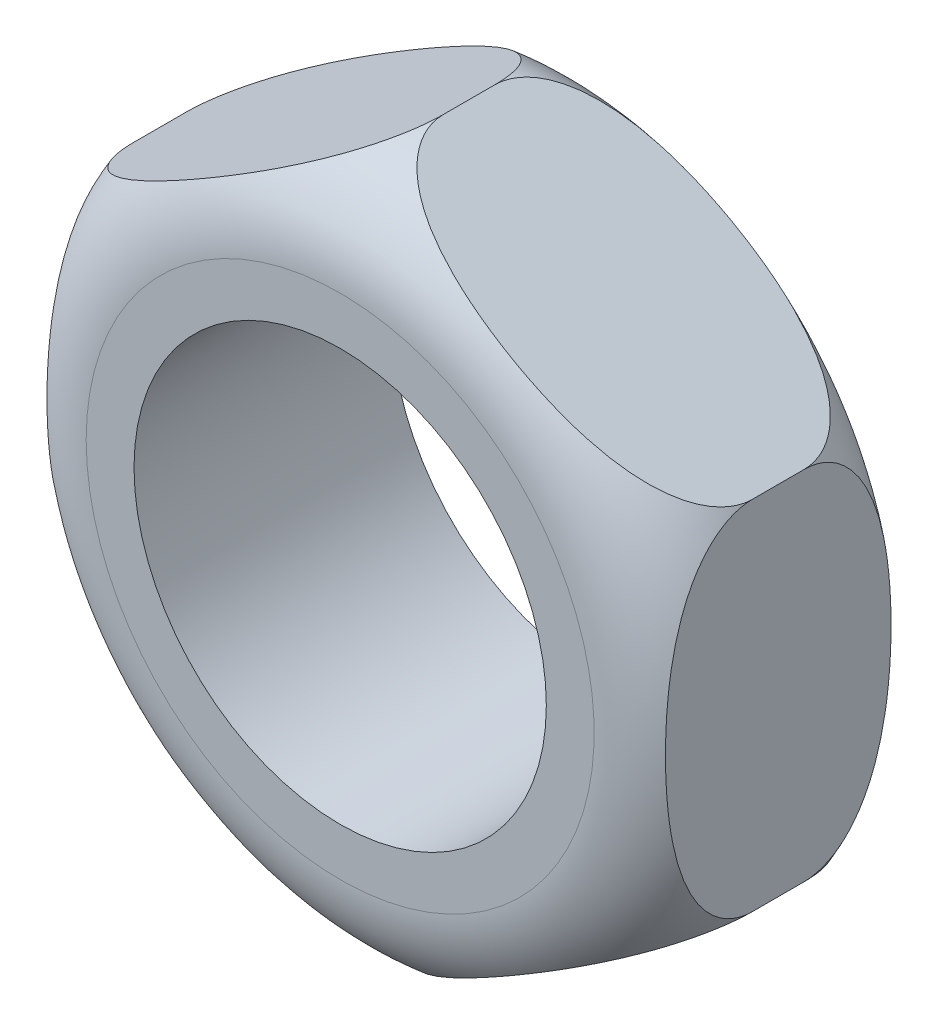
ISO-10303-21;
HEADER;
FILE_DESCRIPTION(('STEP AP214'),'2;1');
FILE_NAME('part.step','',(''),(''),'','','');
FILE_SCHEMA(('AUTOMOTIVE_DESIGN { 1 0 10303 214 1 1 1 1 }'));
ENDSEC;
DATA;
#1=APPLICATION_CONTEXT('core data for automotive mechanical design processes');
#2=APPLICATION_PROTOCOL_DEFINITION('international standard','automotive_design',2000,#1);
#3=PRODUCT_CONTEXT('',#1,'mechanical');
#4=PRODUCT('Part','Part','',(#3));
#5=PRODUCT_RELATED_PRODUCT_CATEGORY('part','',(#4));
#6=PRODUCT_DEFINITION_FORMATION('','',#4);
#7=PRODUCT_DEFINITION_CONTEXT('part definition',#1,'design');
#8=PRODUCT_DEFINITION('design','',#6,#7);
#9=PRODUCT_DEFINITION_SHAPE('','',#8);
#10=(LENGTH_UNIT() NAMED_UNIT(*) SI_UNIT(.MILLI.,.METRE.));
#11=(NAMED_UNIT(*) PLANE_ANGLE_UNIT() SI_UNIT($,.RADIAN.));
#12=(NAMED_UNIT(*) SI_UNIT($,.STERADIAN.) SOLID_ANGLE_UNIT());
#13=UNCERTAINTY_MEASURE_WITH_UNIT(LENGTH_MEASURE(1.E-05),#10,'distance_accuracy_value','');
#14=(GEOMETRIC_REPRESENTATION_CONTEXT(3) GLOBAL_UNCERTAINTY_ASSIGNED_CONTEXT((#13)) GLOBAL_UNIT_ASSIGNED_CONTEXT((#10,
#11,#12)) REPRESENTATION_CONTEXT('',''));
#15=CARTESIAN_POINT('',(0.,0.,0.));
#16=DIRECTION('',(0.,0.,1.));
#17=DIRECTION('',(1.,0.,0.));
#18=AXIS2_PLACEMENT_3D('',#15,#16,#17);
#19=CARTESIAN_POINT('',(3.72748706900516E-13,-28.0717967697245,5.));
#20=DIRECTION('',(0.,0.,1.));
#21=DIRECTION('',(1.,0.,0.));
#22=AXIS2_PLACEMENT_3D('',#19,#20,#21);
#23=PLANE('',#22);
#24=CARTESIAN_POINT('',(0.,-35.,5.));
#25=DIRECTION('',(0.,0.,-1.));
#26=DIRECTION('',(-1.,0.,0.));
#27=AXIS2_PLACEMENT_3D('',#24,#25,#26);
#28=CIRCLE('',#27,4.92820323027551);
#29=CARTESIAN_POINT('',(-4.92820323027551,-35.,5.));
#30=VERTEX_POINT('',#29);
#31=EDGE_CURVE('E217',#30,#30,#28,.T.);
#32=ORIENTED_EDGE('',*,*,#31,.F.);
#33=EDGE_LOOP('',(#32));
#34=FACE_BOUND('',#33,.T.);
#35=CARTESIAN_POINT('',(3.7470027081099E-13,-35.,5.));
#36=DIRECTION('',(0.,0.,1.));
#37=DIRECTION('',(1.,0.,0.));
#38=AXIS2_PLACEMENT_3D('',#35,#36,#37);
#39=CIRCLE('',#38,4.00000000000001);
#40=CARTESIAN_POINT('',(4.00000000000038,-35.,5.));
#41=VERTEX_POINT('',#40);
#42=EDGE_CURVE('E197',#41,#41,#39,.T.);
#43=ORIENTED_EDGE('',*,*,#42,.F.);
#44=EDGE_LOOP('',(#43));
#45=FACE_BOUND('',#44,.T.);
#46=ADVANCED_FACE('F32',(#34,#45),#23,.T.);
#47=CARTESIAN_POINT('',(3.72748706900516E-13,-28.0717967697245,0.));
#48=DIRECTION('',(0.,0.,1.));
#49=DIRECTION('',(1.,0.,0.));
#50=AXIS2_PLACEMENT_3D('',#47,#48,#49);
#51=PLANE('',#50);
#52=CARTESIAN_POINT('',(0.,-35.,0.));
#53=DIRECTION('',(0.,0.,-1.));
#54=DIRECTION('',(-1.,0.,0.));
#55=AXIS2_PLACEMENT_3D('',#52,#53,#54);
#56=CIRCLE('',#55,4.92820323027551);
#57=CARTESIAN_POINT('',(-4.92820323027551,-35.,0.));
#58=VERTEX_POINT('',#57);
#59=EDGE_CURVE('E180',#58,#58,#56,.T.);
#60=ORIENTED_EDGE('',*,*,#59,.T.);
#61=EDGE_LOOP('',(#60));
#62=FACE_BOUND('',#61,.T.);
#63=CARTESIAN_POINT('',(3.7470027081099E-13,-35.,0.));
#64=DIRECTION('',(0.,0.,1.));
#65=DIRECTION('',(1.,0.,0.));
#66=AXIS2_PLACEMENT_3D('',#63,#64,#65);
#67=CIRCLE('',#66,4.00000000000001);
#68=CARTESIAN_POINT('',(4.00000000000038,-35.,0.));
#69=VERTEX_POINT('',#68);
#70=EDGE_CURVE('E201',#69,#69,#67,.T.);
#71=ORIENTED_EDGE('',*,*,#70,.T.);
#72=EDGE_LOOP('',(#71));
#73=FACE_BOUND('',#72,.T.);
#74=ADVANCED_FACE('F206',(#62,#73),#51,.F.);
#75=CARTESIAN_POINT('',(6.00000000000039,-31.5358983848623,5.));
#76=DIRECTION('',(-0.5,-0.866025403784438,0.));
#77=DIRECTION('',(0.866025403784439,-0.5,0.));
#78=AXIS2_PLACEMENT_3D('',#75,#76,#77);
#79=PLANE('',#78);
#80=DIRECTION('',(0.,0.,-1.));
#81=VECTOR('',#80,1.);
#82=CARTESIAN_POINT('',(3.7470027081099E-13,-28.0717967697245,5.));
#83=LINE('',#82,#81);
#84=CARTESIAN_POINT('',(3.7470027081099E-13,-28.0717967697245,2.99999999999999));
#85=VERTEX_POINT('',#84);
#86=CARTESIAN_POINT('',(3.7470027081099E-13,-28.0717967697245,2.00000000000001));
#87=VERTEX_POINT('',#86);
#88=EDGE_CURVE('E112',#85,#87,#83,.T.);
#89=ORIENTED_EDGE('',*,*,#88,.F.);
#90=CARTESIAN_POINT('',(1.73208801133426E-08,-28.0717967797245,2.99979999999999));
#91=CARTESIAN_POINT('',(-9.24129227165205E-06,-28.0717914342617,3.02934367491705));
#92=CARTESIAN_POINT('',(0.00112454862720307,-28.0724460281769,3.05887183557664));
#93=CARTESIAN_POINT('',(0.00563030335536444,-28.0750474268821,3.11768115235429));
#94=CARTESIAN_POINT('',(0.00900084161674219,-28.0769934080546,3.14696245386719));
#95=CARTESIAN_POINT('',(0.022325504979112,-28.0846864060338,3.23369723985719));
#96=CARTESIAN_POINT('',(0.035494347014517,-28.0922894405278,3.29052721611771));
#97=CARTESIAN_POINT('',(0.0694675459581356,-28.1119038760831,3.40083363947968));
#98=CARTESIAN_POINT('',(0.0902547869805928,-28.1239053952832,3.45431729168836));
#99=CARTESIAN_POINT('',(0.13828626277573,-28.1516363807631,3.55734093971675));
#100=CARTESIAN_POINT('',(0.165542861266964,-28.1673729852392,3.60687313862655));
#101=CARTESIAN_POINT('',(0.241450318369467,-28.2111981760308,3.72714474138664));
#102=CARTESIAN_POINT('',(0.293697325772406,-28.2413629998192,3.79485748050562));
#103=CARTESIAN_POINT('',(0.406774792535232,-28.306648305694,3.91990090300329));
#104=CARTESIAN_POINT('',(0.467625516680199,-28.3417804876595,3.97720632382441));
#105=CARTESIAN_POINT('',(0.633948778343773,-28.4378072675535,4.11443493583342));
#106=CARTESIAN_POINT('',(0.744019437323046,-28.501356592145,4.18686576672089));
#107=CARTESIAN_POINT('',(0.972011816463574,-28.632988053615,4.31227447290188));
#108=CARTESIAN_POINT('',(1.08994937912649,-28.701079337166,4.36521160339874));
#109=CARTESIAN_POINT('',(1.33092330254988,-28.8402056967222,4.45629465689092));
#110=CARTESIAN_POINT('',(1.45399181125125,-28.9112593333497,4.4943241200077));
#111=CARTESIAN_POINT('',(1.70249662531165,-29.0547336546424,4.55844611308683));
#112=CARTESIAN_POINT('',(1.82793543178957,-29.1271557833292,4.58452520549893));
#113=CARTESIAN_POINT('',(2.08053860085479,-29.2729962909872,4.62725818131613));
#114=CARTESIAN_POINT('',(2.20770812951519,-29.346417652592,4.6438700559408));
#115=CARTESIAN_POINT('',(2.4625576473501,-29.4935550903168,4.66913492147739));
#116=CARTESIAN_POINT('',(2.59023737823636,-29.5672710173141,4.6777915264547));
#117=CARTESIAN_POINT('',(2.86943808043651,-29.7284676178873,4.68901643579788));
#118=CARTESIAN_POINT('',(3.02100180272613,-29.8159729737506,4.69016291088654));
#119=CARTESIAN_POINT('',(3.32405004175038,-29.9909379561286,4.68276063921));
#120=CARTESIAN_POINT('',(3.47553445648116,-30.0783975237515,4.67420607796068));
#121=CARTESIAN_POINT('',(3.77693692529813,-30.2524123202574,4.64621390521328));
#122=CARTESIAN_POINT('',(3.92685901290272,-30.3389698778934,4.6268363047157));
#123=CARTESIAN_POINT('',(4.22485731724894,-30.5110192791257,4.57458020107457));
#124=CARTESIAN_POINT('',(4.37293560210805,-30.5965123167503,4.54171855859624));
#125=CARTESIAN_POINT('',(4.61603697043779,-30.7368669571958,4.47222654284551));
#126=CARTESIAN_POINT('',(4.71212066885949,-30.7923409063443,4.44059934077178));
#127=CARTESIAN_POINT('',(4.90168158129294,-30.9017839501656,4.36768698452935));
#128=CARTESIAN_POINT('',(4.99515600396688,-30.9557514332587,4.32639190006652));
#129=CARTESIAN_POINT('',(5.17836216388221,-31.061525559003,4.23166332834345));
#130=CARTESIAN_POINT('',(5.26805807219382,-31.113311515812,4.17813558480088));
#131=CARTESIAN_POINT('',(5.43984359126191,-31.2124919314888,4.05659769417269));
#132=CARTESIAN_POINT('',(5.5219479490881,-31.2598949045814,3.98861650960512));
#133=CARTESIAN_POINT('',(5.64628530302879,-31.3316811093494,3.8633506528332));
#134=CARTESIAN_POINT('',(5.69223799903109,-31.3582119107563,3.81101220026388));
#135=CARTESIAN_POINT('',(5.77706311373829,-31.4071857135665,3.69910751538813));
#136=CARTESIAN_POINT('',(5.81594215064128,-31.4296325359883,3.63954812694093));
#137=CARTESIAN_POINT('',(5.87914980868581,-31.4661254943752,3.52296156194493));
#138=CARTESIAN_POINT('',(5.90478446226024,-31.4809256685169,3.46688543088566));
#139=CARTESIAN_POINT('',(5.94760717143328,-31.5056493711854,3.35062109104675));
#140=CARTESIAN_POINT('',(5.96481313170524,-31.5155832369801,3.29044191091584));
#141=CARTESIAN_POINT('',(5.98468672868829,-31.527057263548,3.19148118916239));
#142=CARTESIAN_POINT('',(5.99040665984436,-31.5303596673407,3.15349367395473));
#143=CARTESIAN_POINT('',(5.99807827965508,-31.5347888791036,3.07694805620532));
#144=CARTESIAN_POINT('',(6.00002321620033,-31.5359117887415,3.03838905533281));
#145=CARTESIAN_POINT('',(5.99999998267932,-31.5358983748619,2.99979999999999));
#146=B_SPLINE_CURVE_WITH_KNOTS('',3,(#90,#91,#92,#93,#94,#95,#96,#97,#98,#99,#100,#101,#102,
#103,#104,#105,#106,#107,#108,#109,#110,#111,#112,#113,#114,#115,#116,#117,#118,#119,#120,#121,
#122,#123,#124,#125,#126,#127,#128,#129,#130,#131,#132,#133,#134,#135,#136,#137,#138,#139,#140,
#141,#142,#143,#144,#145),.UNSPECIFIED.,.F.,.F.,(4,2,2,2,2,2,2,2,2,2,2,2,2,2,2,2,2,2,2,2,2,2,2,
2,2,2,2,4),(0.,0.0885718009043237,0.177087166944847,0.35268103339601,0.527882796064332,
0.703422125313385,0.973942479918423,1.24511096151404,1.6814962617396,2.11878856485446,
2.55943201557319,3.00056973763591,3.44364997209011,3.88652881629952,4.41130312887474,
4.93639214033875,5.45859816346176,5.98015319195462,6.32592314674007,6.67204982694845,
7.02093924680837,7.36913602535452,7.59210399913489,7.81486227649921,8.00434089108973,
8.193415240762,8.30885545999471,8.42450197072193),.UNSPECIFIED.);
#147=CARTESIAN_POINT('',(6.00000000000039,-31.5358983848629,2.99999999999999));
#148=VERTEX_POINT('',#147);
#149=EDGE_CURVE('E94',#85,#148,#146,.T.);
#150=ORIENTED_EDGE('',*,*,#149,.T.);
#151=DIRECTION('',(0.,0.,-1.));
#152=VECTOR('',#151,1.);
#153=CARTESIAN_POINT('',(6.00000000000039,-31.5358983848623,5.));
#154=LINE('',#153,#152);
#155=CARTESIAN_POINT('',(6.00000000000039,-31.5358983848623,2.00000000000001));
#156=VERTEX_POINT('',#155);
#157=EDGE_CURVE('E59',#148,#156,#154,.T.);
#158=ORIENTED_EDGE('',*,*,#157,.T.);
#159=CARTESIAN_POINT('',(5.99999998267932,-31.5358983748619,2.00020000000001));
#160=CARTESIAN_POINT('',(6.00000924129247,-31.5359037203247,1.97065632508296));
#161=CARTESIAN_POINT('',(5.998875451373,-31.5352491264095,1.94112816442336));
#162=CARTESIAN_POINT('',(5.99436969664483,-31.5326477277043,1.88231884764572));
#163=CARTESIAN_POINT('',(5.99099915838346,-31.5307017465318,1.85303754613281));
#164=CARTESIAN_POINT('',(5.97767449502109,-31.5230087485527,1.76630276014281));
#165=CARTESIAN_POINT('',(5.96450565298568,-31.5154057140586,1.7094727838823));
#166=CARTESIAN_POINT('',(5.93053245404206,-31.4957912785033,1.59916636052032));
#167=CARTESIAN_POINT('',(5.90974521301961,-31.4837897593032,1.54568270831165));
#168=CARTESIAN_POINT('',(5.86171373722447,-31.4560587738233,1.44265906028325));
#169=CARTESIAN_POINT('',(5.83445713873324,-31.4403221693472,1.39312686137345));
#170=CARTESIAN_POINT('',(5.75854968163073,-31.3964969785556,1.27285525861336));
#171=CARTESIAN_POINT('',(5.70630267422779,-31.3663321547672,1.20514251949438));
#172=CARTESIAN_POINT('',(5.59322520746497,-31.3010468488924,1.08009909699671));
#173=CARTESIAN_POINT('',(5.53237448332,-31.2659146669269,1.02279367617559));
#174=CARTESIAN_POINT('',(5.36605122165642,-31.1698878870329,0.885565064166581));
#175=CARTESIAN_POINT('',(5.25598056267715,-31.1063385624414,0.81313423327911));
#176=CARTESIAN_POINT('',(5.02798818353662,-30.9747071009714,0.687725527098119));
#177=CARTESIAN_POINT('',(4.9100506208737,-30.9066158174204,0.634788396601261));
#178=CARTESIAN_POINT('',(4.66907669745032,-30.7674894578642,0.543705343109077));
#179=CARTESIAN_POINT('',(4.54600818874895,-30.6964358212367,0.505675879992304));
#180=CARTESIAN_POINT('',(4.29750337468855,-30.552961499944,0.441553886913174));
#181=CARTESIAN_POINT('',(4.17206456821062,-30.4805393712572,0.415474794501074));
#182=CARTESIAN_POINT('',(3.91946139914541,-30.3346988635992,0.372741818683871));
#183=CARTESIAN_POINT('',(3.79229187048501,-30.2612775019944,0.356129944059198));
#184=CARTESIAN_POINT('',(3.53744235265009,-30.1141400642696,0.330865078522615));
#185=CARTESIAN_POINT('',(3.40976262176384,-30.0404241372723,0.322208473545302));
#186=CARTESIAN_POINT('',(3.13056191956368,-29.8792275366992,0.310983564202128));
#187=CARTESIAN_POINT('',(2.97899819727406,-29.7917221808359,0.309837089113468));
#188=CARTESIAN_POINT('',(2.67594995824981,-29.6167571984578,0.317239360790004));
#189=CARTESIAN_POINT('',(2.52446554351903,-29.5292976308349,0.325793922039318));
#190=CARTESIAN_POINT('',(2.22306307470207,-29.355282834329,0.353786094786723));
#191=CARTESIAN_POINT('',(2.07314098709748,-29.268725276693,0.373163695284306));
#192=CARTESIAN_POINT('',(1.77514268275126,-29.0966758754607,0.425419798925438));
#193=CARTESIAN_POINT('',(1.62706439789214,-29.0111828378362,0.458281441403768));
#194=CARTESIAN_POINT('',(1.38396302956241,-28.8708281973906,0.527773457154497));
#195=CARTESIAN_POINT('',(1.28787933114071,-28.8153542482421,0.559400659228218));
#196=CARTESIAN_POINT('',(1.09831841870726,-28.7059112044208,0.632313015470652));
#197=CARTESIAN_POINT('',(1.00484399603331,-28.6519437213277,0.673608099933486));
#198=CARTESIAN_POINT('',(0.821637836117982,-28.5461695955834,0.768336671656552));
#199=CARTESIAN_POINT('',(0.731941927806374,-28.4943836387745,0.821864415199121));
#200=CARTESIAN_POINT('',(0.560156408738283,-28.3952032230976,0.943402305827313));
#201=CARTESIAN_POINT('',(0.478052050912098,-28.347800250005,1.01138349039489));
#202=CARTESIAN_POINT('',(0.353714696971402,-28.276014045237,1.13664934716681));
#203=CARTESIAN_POINT('',(0.307762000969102,-28.2494832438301,1.18898779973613));
#204=CARTESIAN_POINT('',(0.222936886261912,-28.2005094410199,1.30089248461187));
#205=CARTESIAN_POINT('',(0.184057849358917,-28.1780626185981,1.36045187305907));
#206=CARTESIAN_POINT('',(0.120850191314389,-28.1415696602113,1.47703843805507));
#207=CARTESIAN_POINT('',(0.0952155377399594,-28.1267694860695,1.53311456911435));
#208=CARTESIAN_POINT('',(0.0523928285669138,-28.102045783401,1.64937890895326));
#209=CARTESIAN_POINT('',(0.035186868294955,-28.0921119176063,1.70955808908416));
#210=CARTESIAN_POINT('',(0.0153132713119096,-28.0806378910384,1.80851881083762));
#211=CARTESIAN_POINT('',(0.00959334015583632,-28.0773354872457,1.84650632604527));
#212=CARTESIAN_POINT('',(0.00192172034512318,-28.0729062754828,1.92305194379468));
#213=CARTESIAN_POINT('',(-2.32162001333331E-05,-28.0717833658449,1.96161094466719));
#214=CARTESIAN_POINT('',(1.73208808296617E-08,-28.0717967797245,2.00020000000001));
#215=B_SPLINE_CURVE_WITH_KNOTS('',3,(#159,#160,#161,#162,#163,#164,#165,#166,#167,#168,#169,
#170,#171,#172,#173,#174,#175,#176,#177,#178,#179,#180,#181,#182,#183,#184,#185,#186,#187,#188,
#189,#190,#191,#192,#193,#194,#195,#196,#197,#198,#199,#200,#201,#202,#203,#204,#205,#206,#207,
#208,#209,#210,#211,#212,#213,#214),.UNSPECIFIED.,.F.,.F.,(4,2,2,2,2,2,2,2,2,2,2,2,2,2,2,2,2,2,
2,2,2,2,2,2,2,2,2,4),(0.,0.0885718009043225,0.177087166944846,0.352681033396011,
0.527882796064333,0.703422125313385,0.973942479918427,1.24511096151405,1.68149626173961,
2.11878856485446,2.5594320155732,3.00056973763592,3.44364997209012,3.88652881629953,
4.41130312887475,4.93639214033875,5.45859816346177,5.98015319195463,6.32592314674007,
6.67204982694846,7.02093924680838,7.36913602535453,7.5921039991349,7.81486227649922,
8.00434089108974,8.193415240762,8.30885545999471,8.42450197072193),.UNSPECIFIED.);
#216=EDGE_CURVE('E161',#156,#87,#215,.T.);
#217=ORIENTED_EDGE('',*,*,#216,.T.);
#218=EDGE_LOOP('',(#89,#150,#158,#217));
#219=FACE_BOUND('',#218,.T.);
#220=ADVANCED_FACE('F34',(#219),#79,.F.);
#221=CARTESIAN_POINT('',(3.7470027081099E-13,-28.0717967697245,5.));
#222=DIRECTION('',(0.5,-0.866025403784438,0.));
#223=DIRECTION('',(0.866025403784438,0.5,0.));
#224=AXIS2_PLACEMENT_3D('',#221,#222,#223);
#225=PLANE('',#224);
#226=DIRECTION('',(0.,0.,-1.));
#227=VECTOR('',#226,1.);
#228=CARTESIAN_POINT('',(-5.99999999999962,-31.5358983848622,5.));
#229=LINE('',#228,#227);
#230=CARTESIAN_POINT('',(-5.99999999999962,-31.5358983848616,2.99999999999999));
#231=VERTEX_POINT('',#230);
#232=CARTESIAN_POINT('',(-5.99999999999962,-31.5358983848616,2.00000000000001));
#233=VERTEX_POINT('',#232);
#234=EDGE_CURVE('E103',#231,#233,#229,.T.);
#235=ORIENTED_EDGE('',*,*,#234,.F.);
#236=CARTESIAN_POINT('',(-5.99999998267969,-31.5358983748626,2.99979999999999));
#237=CARTESIAN_POINT('',(-6.00000924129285,-31.5359037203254,3.02934367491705));
#238=CARTESIAN_POINT('',(-5.99887545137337,-31.5352491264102,3.05887183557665));
#239=CARTESIAN_POINT('',(-5.99436969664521,-31.532647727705,3.11768115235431));
#240=CARTESIAN_POINT('',(-5.99099915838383,-31.5307017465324,3.14696245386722));
#241=CARTESIAN_POINT('',(-5.97767449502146,-31.5230087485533,3.23369723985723));
#242=CARTESIAN_POINT('',(-5.96450565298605,-31.5154057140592,3.29052721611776));
#243=CARTESIAN_POINT('',(-5.93053245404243,-31.4957912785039,3.40083363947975));
#244=CARTESIAN_POINT('',(-5.90974521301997,-31.4837897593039,3.45431729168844));
#245=CARTESIAN_POINT('',(-5.86171373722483,-31.456058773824,3.55734093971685));
#246=CARTESIAN_POINT('',(-5.83445713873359,-31.4403221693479,3.60687313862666));
#247=CARTESIAN_POINT('',(-5.75854968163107,-31.3964969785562,3.72714474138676));
#248=CARTESIAN_POINT('',(-5.70630267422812,-31.3663321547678,3.79485748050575));
#249=CARTESIAN_POINT('',(-5.59322520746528,-31.301046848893,3.91990090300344));
#250=CARTESIAN_POINT('',(-5.53237448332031,-31.2659146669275,3.97720632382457));
#251=CARTESIAN_POINT('',(-5.36605122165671,-31.1698878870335,4.1144349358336));
#252=CARTESIAN_POINT('',(-5.25598056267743,-31.106338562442,4.18686576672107));
#253=CARTESIAN_POINT('',(-5.02798818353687,-30.974707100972,4.31227447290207));
#254=CARTESIAN_POINT('',(-4.91005062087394,-30.906615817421,4.36521160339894));
#255=CARTESIAN_POINT('',(-4.66907669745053,-30.7674894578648,4.45629465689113));
#256=CARTESIAN_POINT('',(-4.54600818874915,-30.6964358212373,4.49432412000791));
#257=CARTESIAN_POINT('',(-4.29750337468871,-30.5529614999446,4.55844611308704));
#258=CARTESIAN_POINT('',(-4.17206456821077,-30.4805393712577,4.58452520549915));
#259=CARTESIAN_POINT('',(-3.91946139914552,-30.3346988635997,4.62725818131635));
#260=CARTESIAN_POINT('',(-3.7922918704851,-30.2612775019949,4.64387005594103));
#261=CARTESIAN_POINT('',(-3.53744235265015,-30.1141400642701,4.66913492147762));
#262=CARTESIAN_POINT('',(-3.40976262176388,-30.0404241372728,4.67779152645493));
#263=CARTESIAN_POINT('',(-3.13056191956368,-29.8792275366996,4.68901643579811));
#264=CARTESIAN_POINT('',(-2.97899819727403,-29.7917221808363,4.69016291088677));
#265=CARTESIAN_POINT('',(-2.67594995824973,-29.6167571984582,4.68276063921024));
#266=CARTESIAN_POINT('',(-2.52446554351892,-29.5292976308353,4.67420607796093));
#267=CARTESIAN_POINT('',(-2.22306307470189,-29.3552828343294,4.64621390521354));
#268=CARTESIAN_POINT('',(-2.07314098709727,-29.2687252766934,4.62683630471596));
#269=CARTESIAN_POINT('',(-1.77514268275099,-29.096675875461,4.57458020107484));
#270=CARTESIAN_POINT('',(-1.62706439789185,-29.0111828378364,4.54171855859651));
#271=CARTESIAN_POINT('',(-1.38396302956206,-28.8708281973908,4.47222654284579));
#272=CARTESIAN_POINT('',(-1.28787933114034,-28.8153542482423,4.44059934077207));
#273=CARTESIAN_POINT('',(-1.09831841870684,-28.705911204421,4.36768698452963));
#274=CARTESIAN_POINT('',(-1.00484399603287,-28.6519437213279,4.3263919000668));
#275=CARTESIAN_POINT('',(-0.821637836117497,-28.5461695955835,4.23166332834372));
#276=CARTESIAN_POINT('',(-0.731941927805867,-28.4943836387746,4.17813558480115));
#277=CARTESIAN_POINT('',(-0.56015640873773,-28.3952032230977,4.05659769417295));
#278=CARTESIAN_POINT('',(-0.478052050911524,-28.3478002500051,3.98861650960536));
#279=CARTESIAN_POINT('',(-0.353714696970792,-28.2760140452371,3.86335065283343));
#280=CARTESIAN_POINT('',(-0.307762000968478,-28.2494832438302,3.8110122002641));
#281=CARTESIAN_POINT('',(-0.222936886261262,-28.2005094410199,3.69910751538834));
#282=CARTESIAN_POINT('',(-0.184057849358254,-28.1780626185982,3.63954812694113));
#283=CARTESIAN_POINT('',(-0.120850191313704,-28.1415696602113,3.52296156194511));
#284=CARTESIAN_POINT('',(-0.0952155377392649,-28.1267694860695,3.46688543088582));
#285=CARTESIAN_POINT('',(-0.0523928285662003,-28.102045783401,3.35062109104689));
#286=CARTESIAN_POINT('',(-0.0351868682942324,-28.0921119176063,3.29044191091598));
#287=CARTESIAN_POINT('',(-0.0153132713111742,-28.0806378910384,3.19148118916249));
#288=CARTESIAN_POINT('',(-0.0095933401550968,-28.0773354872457,3.15349367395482));
#289=CARTESIAN_POINT('',(-0.00192172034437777,-28.0729062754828,3.07694805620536));
#290=CARTESIAN_POINT('',(2.32162008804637E-05,-28.0717833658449,3.03838905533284));
#291=CARTESIAN_POINT('',(-1.73201321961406E-08,-28.0717967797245,2.99979999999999));
#292=B_SPLINE_CURVE_WITH_KNOTS('',3,(#236,#237,#238,#239,#240,#241,#242,#243,#244,#245,#246,
#247,#248,#249,#250,#251,#252,#253,#254,#255,#256,#257,#258,#259,#260,#261,#262,#263,#264,#265,
#266,#267,#268,#269,#270,#271,#272,#273,#274,#275,#276,#277,#278,#279,#280,#281,#282,#283,#284,
#285,#286,#287,#288,#289,#290,#291),.UNSPECIFIED.,.F.,.F.,(4,2,2,2,2,2,2,2,2,2,2,2,2,2,2,2,2,2,
2,2,2,2,2,2,2,2,2,4),(0.,0.0885718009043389,0.177087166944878,0.352681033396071,
0.527882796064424,0.703422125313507,0.973942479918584,1.24511096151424,1.68149626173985,
2.11878856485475,2.55943201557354,3.00056973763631,3.44364997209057,3.88652881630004,
4.41130312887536,4.93639214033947,5.45859816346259,5.98015319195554,6.32592314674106,
6.67204982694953,7.02093924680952,7.36913602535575,7.59210399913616,7.81486227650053,
8.0043408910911,8.19341524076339,8.30885545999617,8.42450197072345),.UNSPECIFIED.);
#293=EDGE_CURVE('E89',#231,#85,#292,.T.);
#294=ORIENTED_EDGE('',*,*,#293,.T.);
#295=ORIENTED_EDGE('',*,*,#88,.T.);
#296=CARTESIAN_POINT('',(-1.73201321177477E-08,-28.0717967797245,2.00020000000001));
#297=CARTESIAN_POINT('',(9.24129301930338E-06,-28.0717914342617,1.97065632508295));
#298=CARTESIAN_POINT('',(-0.0011245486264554,-28.0724460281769,1.94112816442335));
#299=CARTESIAN_POINT('',(-0.00563030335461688,-28.0750474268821,1.8823188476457));
#300=CARTESIAN_POINT('',(-0.00900084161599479,-28.0769934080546,1.85303754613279));
#301=CARTESIAN_POINT('',(-0.0223255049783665,-28.0846864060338,1.76630276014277));
#302=CARTESIAN_POINT('',(-0.0354943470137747,-28.0922894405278,1.70947278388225));
#303=CARTESIAN_POINT('',(-0.0694675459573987,-28.1119038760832,1.59916636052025));
#304=CARTESIAN_POINT('',(-0.0902547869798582,-28.1239053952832,1.54568270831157));
#305=CARTESIAN_POINT('',(-0.138286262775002,-28.1516363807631,1.44265906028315));
#306=CARTESIAN_POINT('',(-0.165542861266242,-28.1673729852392,1.39312686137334));
#307=CARTESIAN_POINT('',(-0.241450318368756,-28.2111981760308,1.27285525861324));
#308=CARTESIAN_POINT('',(-0.293697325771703,-28.2413629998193,1.20514251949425));
#309=CARTESIAN_POINT('',(-0.406774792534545,-28.3066483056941,1.08009909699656));
#310=CARTESIAN_POINT('',(-0.467625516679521,-28.3417804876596,1.02279367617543));
#311=CARTESIAN_POINT('',(-0.633948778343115,-28.4378072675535,0.885565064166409));
#312=CARTESIAN_POINT('',(-0.744019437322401,-28.5013565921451,0.813134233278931));
#313=CARTESIAN_POINT('',(-0.972011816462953,-28.6329880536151,0.687725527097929));
#314=CARTESIAN_POINT('',(-1.08994937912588,-28.7010793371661,0.634788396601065));
#315=CARTESIAN_POINT('',(-1.3309233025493,-28.8402056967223,0.543705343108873));
#316=CARTESIAN_POINT('',(-1.45399181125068,-28.9112593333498,0.505675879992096));
#317=CARTESIAN_POINT('',(-1.70249662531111,-29.0547336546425,0.441553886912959));
#318=CARTESIAN_POINT('',(-1.82793543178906,-29.1271557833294,0.415474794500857));
#319=CARTESIAN_POINT('',(-2.08053860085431,-29.2729962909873,0.37274181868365));
#320=CARTESIAN_POINT('',(-2.20770812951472,-29.3464176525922,0.356129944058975));
#321=CARTESIAN_POINT('',(-2.46255764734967,-29.493555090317,0.330865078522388));
#322=CARTESIAN_POINT('',(-2.59023737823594,-29.5672710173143,0.322208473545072));
#323=CARTESIAN_POINT('',(-2.86943808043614,-29.7284676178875,0.310983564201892));
#324=CARTESIAN_POINT('',(-3.02100180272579,-29.8159729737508,0.30983708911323));
#325=CARTESIAN_POINT('',(-3.3240500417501,-29.9909379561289,0.317239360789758));
#326=CARTESIAN_POINT('',(-3.4755344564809,-30.0783975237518,0.325793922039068));
#327=CARTESIAN_POINT('',(-3.77693692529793,-30.2524123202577,0.353786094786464));
#328=CARTESIAN_POINT('',(-3.92685901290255,-30.3389698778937,0.373163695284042));
#329=CARTESIAN_POINT('',(-4.22485731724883,-30.5110192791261,0.425419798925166));
#330=CARTESIAN_POINT('',(-4.37293560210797,-30.5965123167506,0.458281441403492));
#331=CARTESIAN_POINT('',(-4.61603697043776,-30.7368669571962,0.527773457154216));
#332=CARTESIAN_POINT('',(-4.71212066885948,-30.7923409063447,0.559400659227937));
#333=CARTESIAN_POINT('',(-4.90168158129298,-30.901783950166,0.63231301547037));
#334=CARTESIAN_POINT('',(-4.99515600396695,-30.9557514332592,0.673608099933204));
#335=CARTESIAN_POINT('',(-5.17836216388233,-31.0615255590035,0.768336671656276));
#336=CARTESIAN_POINT('',(-5.26805807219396,-31.1133115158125,0.82186441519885));
#337=CARTESIAN_POINT('',(-5.4398435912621,-31.2124919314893,0.943402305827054));
#338=CARTESIAN_POINT('',(-5.5219479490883,-31.2598949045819,1.01138349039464));
#339=CARTESIAN_POINT('',(-5.64628530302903,-31.3316811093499,1.13664934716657));
#340=CARTESIAN_POINT('',(-5.69223799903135,-31.3582119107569,1.1889877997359));
#341=CARTESIAN_POINT('',(-5.77706311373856,-31.4071857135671,1.30089248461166));
#342=CARTESIAN_POINT('',(-5.81594215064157,-31.4296325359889,1.36045187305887));
#343=CARTESIAN_POINT('',(-5.87914980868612,-31.4661254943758,1.47703843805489));
#344=CARTESIAN_POINT('',(-5.90478446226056,-31.4809256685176,1.53311456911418));
#345=CARTESIAN_POINT('',(-5.94760717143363,-31.5056493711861,1.64937890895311));
#346=CARTESIAN_POINT('',(-5.96481313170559,-31.5155832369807,1.70955808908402));
#347=CARTESIAN_POINT('',(-5.98468672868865,-31.5270572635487,1.80851881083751));
#348=CARTESIAN_POINT('',(-5.99040665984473,-31.5303596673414,1.84650632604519));
#349=CARTESIAN_POINT('',(-5.99807827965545,-31.5347888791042,1.92305194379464));
#350=CARTESIAN_POINT('',(-6.00002321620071,-31.5359117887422,1.96161094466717));
#351=CARTESIAN_POINT('',(-5.99999998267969,-31.5358983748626,2.00020000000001));
#352=B_SPLINE_CURVE_WITH_KNOTS('',3,(#296,#297,#298,#299,#300,#301,#302,#303,#304,#305,#306,
#307,#308,#309,#310,#311,#312,#313,#314,#315,#316,#317,#318,#319,#320,#321,#322,#323,#324,#325,
#326,#327,#328,#329,#330,#331,#332,#333,#334,#335,#336,#337,#338,#339,#340,#341,#342,#343,#344,
#345,#346,#347,#348,#349,#350,#351),.UNSPECIFIED.,.F.,.F.,(4,2,2,2,2,2,2,2,2,2,2,2,2,2,2,2,2,2,
2,2,2,2,2,2,2,2,2,4),(0.,0.0885718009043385,0.177087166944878,0.352681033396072,
0.527882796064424,0.703422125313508,0.973942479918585,1.24511096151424,1.68149626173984,
2.11878856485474,2.55943201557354,3.00056973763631,3.44364997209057,3.88652881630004,
4.41130312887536,4.93639214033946,5.45859816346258,5.98015319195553,6.32592314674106,
6.67204982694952,7.02093924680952,7.36913602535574,7.59210399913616,7.81486227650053,
8.0043408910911,8.1934152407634,8.30885545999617,8.42450197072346),.UNSPECIFIED.);
#353=EDGE_CURVE('E111',#87,#233,#352,.T.);
#354=ORIENTED_EDGE('',*,*,#353,.T.);
#355=EDGE_LOOP('',(#235,#294,#295,#354));
#356=FACE_BOUND('',#355,.T.);
#357=ADVANCED_FACE('F109',(#356),#225,.F.);
#358=CARTESIAN_POINT('',(-5.99999999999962,-31.5358983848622,5.));
#359=DIRECTION('',(1.,0.,0.));
#360=DIRECTION('',(0.,1.,0.));
#361=AXIS2_PLACEMENT_3D('',#358,#359,#360);
#362=PLANE('',#361);
#363=DIRECTION('',(0.,0.,-1.));
#364=VECTOR('',#363,1.);
#365=CARTESIAN_POINT('',(-5.99999999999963,-38.4641016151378,5.));
#366=LINE('',#365,#364);
#367=CARTESIAN_POINT('',(-6.00000000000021,-38.4641016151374,2.99999999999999));
#368=VERTEX_POINT('',#367);
#369=CARTESIAN_POINT('',(-6.00000000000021,-38.4641016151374,2.00000000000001));
#370=VERTEX_POINT('',#369);
#371=EDGE_CURVE('E105',#368,#370,#366,.T.);
#372=ORIENTED_EDGE('',*,*,#371,.F.);
#373=CARTESIAN_POINT('',(-5.99999999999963,-35.,4.68856497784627));
#374=CARTESIAN_POINT('',(-5.99999999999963,-34.8313958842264,4.68857152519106));
#375=CARTESIAN_POINT('',(-5.99999999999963,-34.6627774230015,4.68410578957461));
#376=CARTESIAN_POINT('',(-5.99999999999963,-34.3259254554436,4.66564477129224));
#377=CARTESIAN_POINT('',(-5.99999999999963,-34.1576923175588,4.65164257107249));
#378=CARTESIAN_POINT('',(-5.99999999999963,-33.8225669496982,4.61223562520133));
#379=CARTESIAN_POINT('',(-5.99999999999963,-33.6556742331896,4.58683522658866));
#380=CARTESIAN_POINT('',(-5.99999999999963,-33.3249128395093,4.5214639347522));
#381=CARTESIAN_POINT('',(-5.99999999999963,-33.1610400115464,4.48151489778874));
#382=CARTESIAN_POINT('',(-5.99999999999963,-32.8549588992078,4.38712344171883));
#383=CARTESIAN_POINT('',(-5.99999999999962,-32.7122157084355,4.33451519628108));
#384=CARTESIAN_POINT('',(-5.99999999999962,-32.5052781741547,4.24033987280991));
#385=CARTESIAN_POINT('',(-5.99999999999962,-32.4375865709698,4.20646335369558));
#386=CARTESIAN_POINT('',(-5.99999999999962,-32.3054478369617,4.13292545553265));
#387=CARTESIAN_POINT('',(-5.99999999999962,-32.2409982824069,4.09326848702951));
#388=CARTESIAN_POINT('',(-5.99999999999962,-32.1102283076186,4.00310383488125));
#389=CARTESIAN_POINT('',(-5.99999999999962,-32.0443770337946,3.95190460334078));
#390=CARTESIAN_POINT('',(-5.99999999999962,-31.9203909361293,3.84077297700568));
#391=CARTESIAN_POINT('',(-5.99999999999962,-31.8622517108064,3.78084560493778));
#392=CARTESIAN_POINT('',(-5.99999999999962,-31.7661104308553,3.66319433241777));
#393=CARTESIAN_POINT('',(-5.99999999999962,-31.7263647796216,3.60690892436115));
#394=CARTESIAN_POINT('',(-5.99999999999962,-31.6566036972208,3.48858075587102));
#395=CARTESIAN_POINT('',(-5.99999999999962,-31.6265750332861,3.42654597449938));
#396=CARTESIAN_POINT('',(-5.99999999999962,-31.5822357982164,3.30792868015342));
#397=CARTESIAN_POINT('',(-5.99999999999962,-31.5662108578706,3.25199038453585));
#398=CARTESIAN_POINT('',(-5.99999999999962,-31.5438191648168,3.13820466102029));
#399=CARTESIAN_POINT('',(-5.99999999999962,-31.5374476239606,3.08035819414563));
#400=CARTESIAN_POINT('',(-5.99999999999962,-31.53484892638,2.9643521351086));
#401=CARTESIAN_POINT('',(-5.99999999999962,-31.5386363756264,2.90619221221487));
#402=CARTESIAN_POINT('',(-5.99999999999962,-31.5560873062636,2.79137983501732));
#403=CARTESIAN_POINT('',(-5.99999999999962,-31.569753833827,2.73472785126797));
#404=CARTESIAN_POINT('',(-5.99999999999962,-31.605771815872,2.62502382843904));
#405=CARTESIAN_POINT('',(-5.99999999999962,-31.628021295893,2.57193780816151));
#406=CARTESIAN_POINT('',(-5.99999999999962,-31.6799041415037,2.46954366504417));
#407=CARTESIAN_POINT('',(-5.99999999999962,-31.7095403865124,2.42023702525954));
#408=CARTESIAN_POINT('',(-5.99999999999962,-31.7920898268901,2.30092526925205));
#409=CARTESIAN_POINT('',(-5.99999999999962,-31.8490381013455,2.23370998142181));
#410=CARTESIAN_POINT('',(-5.99999999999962,-31.972863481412,2.1091514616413));
#411=CARTESIAN_POINT('',(-5.99999999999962,-32.0397657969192,2.05183411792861));
#412=CARTESIAN_POINT('',(-5.99999999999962,-32.2216057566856,1.91531676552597));
#413=CARTESIAN_POINT('',(-5.99999999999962,-32.3416871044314,1.84302226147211));
#414=CARTESIAN_POINT('',(-5.99999999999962,-32.5910434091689,1.71698911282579));
#415=CARTESIAN_POINT('',(-5.99999999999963,-32.7203367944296,1.66328899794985));
#416=CARTESIAN_POINT('',(-5.99999999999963,-32.9823828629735,1.57105246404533));
#417=CARTESIAN_POINT('',(-5.99999999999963,-33.1150767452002,1.53234463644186));
#418=CARTESIAN_POINT('',(-5.99999999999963,-33.3832952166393,1.46615535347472));
#419=CARTESIAN_POINT('',(-5.99999999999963,-33.5188226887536,1.43868598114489));
#420=CARTESIAN_POINT('',(-5.99999999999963,-33.791870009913,1.3926716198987));
#421=CARTESIAN_POINT('',(-5.99999999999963,-33.9293954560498,1.37416078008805));
#422=CARTESIAN_POINT('',(-5.99999999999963,-34.2051619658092,1.34463146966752));
#423=CARTESIAN_POINT('',(-5.99999999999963,-34.3434027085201,1.33360989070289));
#424=CARTESIAN_POINT('',(-5.99999999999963,-34.6685481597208,1.31531229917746));
#425=CARTESIAN_POINT('',(-5.99999999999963,-34.8556031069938,1.31068488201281));
#426=CARTESIAN_POINT('',(-5.99999999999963,-35.2297793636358,1.31237798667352));
#427=CARTESIAN_POINT('',(-5.99999999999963,-35.4169006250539,1.31870632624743));
#428=CARTESIAN_POINT('',(-5.99999999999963,-35.7901550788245,1.34337069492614));
#429=CARTESIAN_POINT('',(-5.99999999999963,-35.9762893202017,1.36168903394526));
#430=CARTESIAN_POINT('',(-5.99999999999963,-36.2538255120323,1.40040651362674));
#431=CARTESIAN_POINT('',(-5.99999999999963,-36.346019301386,1.41517657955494));
#432=CARTESIAN_POINT('',(-5.99999999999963,-36.5295987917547,1.44905313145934));
#433=CARTESIAN_POINT('',(-5.99999999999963,-36.6209846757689,1.46815860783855));
#434=CARTESIAN_POINT('',(-5.99999999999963,-36.8033043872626,1.5115869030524));
#435=CARTESIAN_POINT('',(-5.99999999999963,-36.894228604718,1.53595060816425));
#436=CARTESIAN_POINT('',(-5.99999999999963,-37.0742277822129,1.59068534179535));
#437=CARTESIAN_POINT('',(-5.99999999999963,-37.1633036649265,1.6210532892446));
#438=CARTESIAN_POINT('',(-5.99999999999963,-37.3382969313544,1.68869663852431));
#439=CARTESIAN_POINT('',(-5.99999999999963,-37.4242283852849,1.72593512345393));
#440=CARTESIAN_POINT('',(-5.99999999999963,-37.5920017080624,1.80860760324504));
#441=CARTESIAN_POINT('',(-5.99999999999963,-37.6738485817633,1.85403123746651));
#442=CARTESIAN_POINT('',(-5.99999999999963,-37.8208414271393,1.94762265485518));
#443=CARTESIAN_POINT('',(-5.99999999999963,-37.8867472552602,1.9945835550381));
#444=CARTESIAN_POINT('',(-5.99999999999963,-38.0122534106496,2.09654168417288));
#445=CARTESIAN_POINT('',(-5.99999999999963,-38.0718470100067,2.15154734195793));
#446=CARTESIAN_POINT('',(-5.99999999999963,-38.1826598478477,2.27080506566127));
#447=CARTESIAN_POINT('',(-5.99999999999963,-38.2337716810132,2.33515881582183));
#448=CARTESIAN_POINT('',(-5.99999999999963,-38.3230508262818,2.47229349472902));
#449=CARTESIAN_POINT('',(-5.99999999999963,-38.3612531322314,2.54505091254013));
#450=CARTESIAN_POINT('',(-5.99999999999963,-38.4123036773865,2.67520114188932));
#451=CARTESIAN_POINT('',(-5.99999999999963,-38.4292861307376,2.73097704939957));
#452=CARTESIAN_POINT('',(-5.99999999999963,-38.4536444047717,2.84459813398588));
#453=CARTESIAN_POINT('',(-5.99999999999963,-38.4610262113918,2.90244199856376));
#454=CARTESIAN_POINT('',(-5.99999999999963,-38.4656198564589,3.01864328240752));
#455=CARTESIAN_POINT('',(-5.99999999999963,-38.4628128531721,3.07700145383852));
#456=CARTESIAN_POINT('',(-5.99999999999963,-38.4472126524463,3.19236236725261));
#457=CARTESIAN_POINT('',(-5.99999999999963,-38.4344166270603,3.24936472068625));
#458=CARTESIAN_POINT('',(-5.99999999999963,-38.4000725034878,3.35954912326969));
#459=CARTESIAN_POINT('',(-5.99999999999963,-38.3786786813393,3.41278000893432));
#460=CARTESIAN_POINT('',(-5.99999999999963,-38.3284228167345,3.51555710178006));
#461=CARTESIAN_POINT('',(-5.99999999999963,-38.2995575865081,3.56510172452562));
#462=CARTESIAN_POINT('',(-5.99999999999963,-38.2194031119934,3.68424362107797));
#463=CARTESIAN_POINT('',(-5.99999999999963,-38.1641818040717,3.75119711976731));
#464=CARTESIAN_POINT('',(-5.99999999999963,-38.0438208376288,3.87547509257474));
#465=CARTESIAN_POINT('',(-5.99999999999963,-37.9786581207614,3.93277651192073));
#466=CARTESIAN_POINT('',(-5.99999999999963,-37.8020654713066,4.0688589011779));
#467=CARTESIAN_POINT('',(-5.99999999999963,-37.6855838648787,4.14103363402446));
#468=CARTESIAN_POINT('',(-5.99999999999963,-37.4432823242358,4.26734402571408));
#469=CARTESIAN_POINT('',(-5.99999999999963,-37.3174374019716,4.32142913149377));
#470=CARTESIAN_POINT('',(-5.99999999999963,-37.063302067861,4.41426863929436));
#471=CARTESIAN_POINT('',(-5.99999999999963,-36.9351167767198,4.45331819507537));
#472=CARTESIAN_POINT('',(-5.99999999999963,-36.6758598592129,4.52052337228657));
#473=CARTESIAN_POINT('',(-5.99999999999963,-36.5447852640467,4.54866717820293));
#474=CARTESIAN_POINT('',(-5.99999999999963,-36.2810311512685,4.59618443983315));
#475=CARTESIAN_POINT('',(-5.99999999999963,-36.1483508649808,4.61555350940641));
#476=CARTESIAN_POINT('',(-5.99999999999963,-35.8822203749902,4.64704705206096));
#477=CARTESIAN_POINT('',(-5.99999999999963,-35.748770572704,4.65917500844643));
#478=CARTESIAN_POINT('',(-5.99999999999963,-35.5127529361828,4.67509046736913));
#479=CARTESIAN_POINT('',(-5.99999999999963,-35.4102680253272,4.68016573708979));
#480=CARTESIAN_POINT('',(-5.99999999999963,-35.2051905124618,4.68690097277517));
#481=CARTESIAN_POINT('',(-5.99999999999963,-35.1025979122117,4.68856099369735));
#482=CARTESIAN_POINT('',(-5.99999999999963,-35.,4.68856497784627));
#483=B_SPLINE_CURVE_WITH_KNOTS('',3,(#373,#374,#375,#376,#377,#378,#379,#380,#381,#382,#383,
#384,#385,#386,#387,#388,#389,#390,#391,#392,#393,#394,#395,#396,#397,#398,#399,#400,#401,#402,
#403,#404,#405,#406,#407,#408,#409,#410,#411,#412,#413,#414,#415,#416,#417,#418,#419,#420,#421,
#422,#423,#424,#425,#426,#427,#428,#429,#430,#431,#432,#433,#434,#435,#436,#437,#438,#439,#440,
#441,#442,#443,#444,#445,#446,#447,#448,#449,#450,#451,#452,#453,#454,#455,#456,#457,#458,#459,
#460,#461,#462,#463,#464,#465,#466,#467,#468,#469,#470,#471,#472,#473,#474,#475,#476,#477,#478,
#479,#480,#481,#482),.UNSPECIFIED.,.T.,.F.,(4,2,2,2,2,2,2,2,2,2,2,2,2,2,2,2,2,2,2,2,2,2,2,2,2,2,
2,2,2,2,2,2,2,2,2,2,2,2,2,2,2,2,2,2,2,2,2,2,2,2,2,2,2,2,4),(0.,0.505772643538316,
1.01191255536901,1.5178595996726,2.02304967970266,2.47805042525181,2.70490524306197,
2.93158786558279,3.1811787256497,3.43062651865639,3.63656974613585,3.84223132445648,
4.01603128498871,4.18974501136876,4.36370862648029,4.53772590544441,4.70973637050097,
4.88181399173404,5.14459875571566,5.40806075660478,5.82617987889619,6.24516027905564,
6.65919809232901,7.07367989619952,7.48972945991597,7.90560624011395,8.46658596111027,
9.02796614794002,9.58851993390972,9.86854716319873,10.1485092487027,10.4307321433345,
10.7128105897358,10.9934153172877,11.2736673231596,11.5159254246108,11.7584391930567,
12.0038218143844,12.2485338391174,12.4227032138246,12.5967639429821,12.771146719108,
12.9455788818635,13.1170116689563,13.2885177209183,13.5474021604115,13.8068964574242,
14.2156682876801,14.6255731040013,15.0269620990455,15.4287847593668,15.830808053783,
16.2326378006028,16.5404123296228,16.8481819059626),.UNSPECIFIED.);
#484=EDGE_CURVE('E92',#368,#231,#483,.T.);
#485=ORIENTED_EDGE('',*,*,#484,.T.);
#486=ORIENTED_EDGE('',*,*,#234,.T.);
#487=CARTESIAN_POINT('',(-5.99999999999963,-35.,0.31143502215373));
#488=CARTESIAN_POINT('',(-5.99999999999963,-35.1686041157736,0.311428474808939));
#489=CARTESIAN_POINT('',(-5.99999999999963,-35.3372225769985,0.315894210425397));
#490=CARTESIAN_POINT('',(-5.99999999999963,-35.6740745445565,0.334355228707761));
#491=CARTESIAN_POINT('',(-5.99999999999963,-35.8423076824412,0.348357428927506));
#492=CARTESIAN_POINT('',(-5.99999999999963,-36.1774330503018,0.387764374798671));
#493=CARTESIAN_POINT('',(-5.99999999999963,-36.3443257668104,0.413164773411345));
#494=CARTESIAN_POINT('',(-5.99999999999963,-36.6750871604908,0.478536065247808));
#495=CARTESIAN_POINT('',(-5.99999999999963,-36.8389599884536,0.518485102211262));
#496=CARTESIAN_POINT('',(-5.99999999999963,-37.1450411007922,0.612876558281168));
#497=CARTESIAN_POINT('',(-5.99999999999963,-37.2877842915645,0.665484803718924));
#498=CARTESIAN_POINT('',(-5.99999999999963,-37.4947218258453,0.759660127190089));
#499=CARTESIAN_POINT('',(-5.99999999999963,-37.5624134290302,0.793536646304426));
#500=CARTESIAN_POINT('',(-5.99999999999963,-37.6945521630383,0.867074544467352));
#501=CARTESIAN_POINT('',(-5.99999999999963,-37.7590017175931,0.906731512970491));
#502=CARTESIAN_POINT('',(-5.99999999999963,-37.8897716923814,0.996896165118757));
#503=CARTESIAN_POINT('',(-5.99999999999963,-37.9556229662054,1.04809539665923));
#504=CARTESIAN_POINT('',(-5.99999999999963,-38.0796090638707,1.15922702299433));
#505=CARTESIAN_POINT('',(-5.99999999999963,-38.1377482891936,1.21915439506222));
#506=CARTESIAN_POINT('',(-5.99999999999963,-38.2338895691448,1.33680566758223));
#507=CARTESIAN_POINT('',(-5.99999999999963,-38.2736352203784,1.39309107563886));
#508=CARTESIAN_POINT('',(-5.99999999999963,-38.3433963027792,1.51141924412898));
#509=CARTESIAN_POINT('',(-5.99999999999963,-38.3734249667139,1.57345402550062));
#510=CARTESIAN_POINT('',(-5.99999999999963,-38.4177642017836,1.69207131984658));
#511=CARTESIAN_POINT('',(-5.99999999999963,-38.4337891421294,1.74800961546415));
#512=CARTESIAN_POINT('',(-5.99999999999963,-38.4561808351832,1.86179533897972));
#513=CARTESIAN_POINT('',(-5.99999999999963,-38.4625523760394,1.91964180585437));
#514=CARTESIAN_POINT('',(-5.99999999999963,-38.46515107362,2.0356478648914));
#515=CARTESIAN_POINT('',(-5.99999999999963,-38.4613636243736,2.09380778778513));
#516=CARTESIAN_POINT('',(-5.99999999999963,-38.4439126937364,2.20862016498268));
#517=CARTESIAN_POINT('',(-5.99999999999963,-38.430246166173,2.26527214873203));
#518=CARTESIAN_POINT('',(-5.99999999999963,-38.394228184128,2.37497617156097));
#519=CARTESIAN_POINT('',(-5.99999999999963,-38.371978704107,2.42806219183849));
#520=CARTESIAN_POINT('',(-5.99999999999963,-38.3200958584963,2.53045633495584));
#521=CARTESIAN_POINT('',(-5.99999999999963,-38.2904596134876,2.57976297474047));
#522=CARTESIAN_POINT('',(-5.99999999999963,-38.2079101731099,2.69907473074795));
#523=CARTESIAN_POINT('',(-5.99999999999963,-38.1509618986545,2.7662900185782));
#524=CARTESIAN_POINT('',(-5.99999999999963,-38.027136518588,2.8908485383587));
#525=CARTESIAN_POINT('',(-5.99999999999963,-37.9602342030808,2.94816588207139));
#526=CARTESIAN_POINT('',(-5.99999999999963,-37.7783942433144,3.08468323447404));
#527=CARTESIAN_POINT('',(-5.99999999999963,-37.6583128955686,3.15697773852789));
#528=CARTESIAN_POINT('',(-5.99999999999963,-37.4089565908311,3.28301088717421));
#529=CARTESIAN_POINT('',(-5.99999999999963,-37.2796632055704,3.33671100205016));
#530=CARTESIAN_POINT('',(-5.99999999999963,-37.0176171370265,3.42894753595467));
#531=CARTESIAN_POINT('',(-5.99999999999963,-36.8849232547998,3.46765536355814));
#532=CARTESIAN_POINT('',(-5.99999999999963,-36.6167047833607,3.53384464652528));
#533=CARTESIAN_POINT('',(-5.99999999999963,-36.4811773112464,3.56131401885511));
#534=CARTESIAN_POINT('',(-5.99999999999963,-36.208129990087,3.60732838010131));
#535=CARTESIAN_POINT('',(-5.99999999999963,-36.0706045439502,3.62583921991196));
#536=CARTESIAN_POINT('',(-5.99999999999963,-35.7948380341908,3.65536853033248));
#537=CARTESIAN_POINT('',(-5.99999999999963,-35.6565972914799,3.66639010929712));
#538=CARTESIAN_POINT('',(-5.99999999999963,-35.3314518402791,3.68468770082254));
#539=CARTESIAN_POINT('',(-5.99999999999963,-35.1443968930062,3.68931511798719));
#540=CARTESIAN_POINT('',(-5.99999999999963,-34.7702206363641,3.68762201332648));
#541=CARTESIAN_POINT('',(-5.99999999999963,-34.5830993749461,3.68129367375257));
#542=CARTESIAN_POINT('',(-5.99999999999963,-34.2098449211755,3.65662930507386));
#543=CARTESIAN_POINT('',(-5.99999999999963,-34.0237106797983,3.63831096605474));
#544=CARTESIAN_POINT('',(-5.99999999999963,-33.7461744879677,3.59959348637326));
#545=CARTESIAN_POINT('',(-5.99999999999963,-33.653980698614,3.58482342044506));
#546=CARTESIAN_POINT('',(-5.99999999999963,-33.4704012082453,3.55094686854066));
#547=CARTESIAN_POINT('',(-5.99999999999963,-33.3790153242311,3.53184139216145));
#548=CARTESIAN_POINT('',(-5.99999999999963,-33.1966956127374,3.4884130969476));
#549=CARTESIAN_POINT('',(-5.99999999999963,-33.105771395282,3.46404939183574));
#550=CARTESIAN_POINT('',(-5.99999999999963,-32.9257722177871,3.40931465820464));
#551=CARTESIAN_POINT('',(-5.99999999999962,-32.8366963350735,3.37894671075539));
#552=CARTESIAN_POINT('',(-5.99999999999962,-32.6617030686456,3.31130336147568));
#553=CARTESIAN_POINT('',(-5.99999999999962,-32.5757716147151,3.27406487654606));
#554=CARTESIAN_POINT('',(-5.99999999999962,-32.4079982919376,3.19139239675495));
#555=CARTESIAN_POINT('',(-5.99999999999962,-32.3261514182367,3.14596876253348));
#556=CARTESIAN_POINT('',(-5.99999999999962,-32.1791585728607,3.05237734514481));
#557=CARTESIAN_POINT('',(-5.99999999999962,-32.1132527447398,3.00541644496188));
#558=CARTESIAN_POINT('',(-5.99999999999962,-31.9877465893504,2.9034583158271));
#559=CARTESIAN_POINT('',(-5.99999999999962,-31.9281529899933,2.84845265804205));
#560=CARTESIAN_POINT('',(-5.99999999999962,-31.8173401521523,2.72919493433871));
#561=CARTESIAN_POINT('',(-5.99999999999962,-31.7662283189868,2.66484118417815));
#562=CARTESIAN_POINT('',(-5.99999999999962,-31.6769491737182,2.52770650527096));
#563=CARTESIAN_POINT('',(-5.99999999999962,-31.6387468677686,2.45494908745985));
#564=CARTESIAN_POINT('',(-5.99999999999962,-31.5876963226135,2.32479885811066));
#565=CARTESIAN_POINT('',(-5.99999999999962,-31.5707138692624,2.26902295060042));
#566=CARTESIAN_POINT('',(-5.99999999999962,-31.5463555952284,2.1554018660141));
#567=CARTESIAN_POINT('',(-5.99999999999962,-31.5389737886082,2.09755800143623));
#568=CARTESIAN_POINT('',(-5.99999999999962,-31.5343801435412,1.98135671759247));
#569=CARTESIAN_POINT('',(-5.99999999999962,-31.5371871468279,1.92299854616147));
#570=CARTESIAN_POINT('',(-5.99999999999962,-31.5527873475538,1.80763763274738));
#571=CARTESIAN_POINT('',(-5.99999999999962,-31.5655833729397,1.75063527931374));
#572=CARTESIAN_POINT('',(-5.99999999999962,-31.5999274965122,1.6404508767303));
#573=CARTESIAN_POINT('',(-5.99999999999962,-31.6213213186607,1.58721999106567));
#574=CARTESIAN_POINT('',(-5.99999999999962,-31.6715771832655,1.48444289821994));
#575=CARTESIAN_POINT('',(-5.99999999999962,-31.700442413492,1.43489827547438));
#576=CARTESIAN_POINT('',(-5.99999999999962,-31.7805968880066,1.31575637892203));
#577=CARTESIAN_POINT('',(-5.99999999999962,-31.8358181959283,1.24880288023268));
#578=CARTESIAN_POINT('',(-5.99999999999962,-31.9561791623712,1.12452490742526));
#579=CARTESIAN_POINT('',(-5.99999999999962,-32.0213418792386,1.06722348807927));
#580=CARTESIAN_POINT('',(-5.99999999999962,-32.1979345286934,0.931141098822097));
#581=CARTESIAN_POINT('',(-5.99999999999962,-32.3144161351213,0.858966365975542));
#582=CARTESIAN_POINT('',(-5.99999999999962,-32.5567176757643,0.732655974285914));
#583=CARTESIAN_POINT('',(-5.99999999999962,-32.6825625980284,0.678570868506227));
#584=CARTESIAN_POINT('',(-5.99999999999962,-32.936697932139,0.585731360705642));
#585=CARTESIAN_POINT('',(-5.99999999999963,-33.0648832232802,0.546681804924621));
#586=CARTESIAN_POINT('',(-5.99999999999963,-33.3241401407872,0.479476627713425));
#587=CARTESIAN_POINT('',(-5.99999999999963,-33.4552147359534,0.451332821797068));
#588=CARTESIAN_POINT('',(-5.99999999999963,-33.7189688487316,0.403815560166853));
#589=CARTESIAN_POINT('',(-5.99999999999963,-33.8516491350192,0.384446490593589));
#590=CARTESIAN_POINT('',(-5.99999999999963,-34.1177796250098,0.352952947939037));
#591=CARTESIAN_POINT('',(-5.99999999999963,-34.2512294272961,0.340824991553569));
#592=CARTESIAN_POINT('',(-5.99999999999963,-34.4872470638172,0.324909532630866));
#593=CARTESIAN_POINT('',(-5.99999999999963,-34.5897319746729,0.319834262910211));
#594=CARTESIAN_POINT('',(-5.99999999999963,-34.7948094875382,0.313099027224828));
#595=CARTESIAN_POINT('',(-5.99999999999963,-34.8974020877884,0.311439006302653));
#596=CARTESIAN_POINT('',(-5.99999999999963,-35.,0.31143502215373));
#597=B_SPLINE_CURVE_WITH_KNOTS('',3,(#487,#488,#489,#490,#491,#492,#493,#494,#495,#496,#497,
#498,#499,#500,#501,#502,#503,#504,#505,#506,#507,#508,#509,#510,#511,#512,#513,#514,#515,#516,
#517,#518,#519,#520,#521,#522,#523,#524,#525,#526,#527,#528,#529,#530,#531,#532,#533,#534,#535,
#536,#537,#538,#539,#540,#541,#542,#543,#544,#545,#546,#547,#548,#549,#550,#551,#552,#553,#554,
#555,#556,#557,#558,#559,#560,#561,#562,#563,#564,#565,#566,#567,#568,#569,#570,#571,#572,#573,
#574,#575,#576,#577,#578,#579,#580,#581,#582,#583,#584,#585,#586,#587,#588,#589,#590,#591,#592,
#593,#594,#595,#596),.UNSPECIFIED.,.T.,.F.,(4,2,2,2,2,2,2,2,2,2,2,2,2,2,2,2,2,2,2,2,2,2,2,2,2,2,
2,2,2,2,2,2,2,2,2,2,2,2,2,2,2,2,2,2,2,2,2,2,2,2,2,2,2,2,4),(0.,0.505772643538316,
1.01191255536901,1.51785959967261,2.02304967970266,2.47805042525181,2.70490524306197,
2.93158786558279,3.18117872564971,3.4306265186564,3.63656974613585,3.84223132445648,
4.01603128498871,4.18974501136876,4.36370862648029,4.53772590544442,4.70973637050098,
4.88181399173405,5.14459875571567,5.40806075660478,5.8261798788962,6.24516027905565,
6.65919809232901,7.07367989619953,7.48972945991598,7.90560624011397,8.4665859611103,
9.02796614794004,9.58851993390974,9.86854716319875,10.1485092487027,10.4307321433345,
10.7128105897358,10.9934153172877,11.2736673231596,11.5159254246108,11.7584391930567,
12.0038218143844,12.2485338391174,12.4227032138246,12.5967639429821,12.771146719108,
12.9455788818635,13.1170116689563,13.2885177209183,13.5474021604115,13.8068964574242,
14.2156682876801,14.6255731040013,15.0269620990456,15.4287847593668,15.8308080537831,
16.2326378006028,16.5404123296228,16.8481819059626),.UNSPECIFIED.);
#598=EDGE_CURVE('E153',#233,#370,#597,.T.);
#599=ORIENTED_EDGE('',*,*,#598,.T.);
#600=EDGE_LOOP('',(#372,#485,#486,#599));
#601=FACE_BOUND('',#600,.T.);
#602=ADVANCED_FACE('F101',(#601),#362,.F.);
#603=CARTESIAN_POINT('',(-5.99999999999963,-38.4641016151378,5.));
#604=DIRECTION('',(0.500000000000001,0.866025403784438,0.));
#605=DIRECTION('',(-0.866025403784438,0.500000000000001,0.));
#606=AXIS2_PLACEMENT_3D('',#603,#604,#605);
#607=PLANE('',#606);
#608=DIRECTION('',(0.,0.,-1.));
#609=VECTOR('',#608,1.);
#610=CARTESIAN_POINT('',(3.7470027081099E-13,-41.9282032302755,5.));
#611=LINE('',#610,#609);
#612=CARTESIAN_POINT('',(3.49980461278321E-13,-41.9282032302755,2.99999999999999));
#613=VERTEX_POINT('',#612);
#614=CARTESIAN_POINT('',(3.49980461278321E-13,-41.9282032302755,2.00000000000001));
#615=VERTEX_POINT('',#614);
#616=EDGE_CURVE('E115',#613,#615,#611,.T.);
#617=ORIENTED_EDGE('',*,*,#616,.F.);
#618=CARTESIAN_POINT('',(-1.73201085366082E-08,-41.9282032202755,2.99979999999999));
#619=CARTESIAN_POINT('',(9.24129304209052E-06,-41.9282085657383,3.02934367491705));
#620=CARTESIAN_POINT('',(-0.00112454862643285,-41.9275539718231,3.05887183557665));
#621=CARTESIAN_POINT('',(-0.00563030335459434,-41.9249525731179,3.11768115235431));
#622=CARTESIAN_POINT('',(-0.00900084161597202,-41.9230065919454,3.14696245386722));
#623=CARTESIAN_POINT('',(-0.0223255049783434,-41.9153135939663,3.23369723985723));
#624=CARTESIAN_POINT('',(-0.035494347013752,-41.9077105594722,3.29052721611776));
#625=CARTESIAN_POINT('',(-0.0694675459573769,-41.8880961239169,3.40083363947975));
#626=CARTESIAN_POINT('',(-0.0902547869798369,-41.8760946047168,3.45431729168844));
#627=CARTESIAN_POINT('',(-0.13828626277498,-41.8483636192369,3.55734093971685));
#628=CARTESIAN_POINT('',(-0.165542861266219,-41.8326270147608,3.60687313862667));
#629=CARTESIAN_POINT('',(-0.241450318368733,-41.7888018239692,3.72714474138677));
#630=CARTESIAN_POINT('',(-0.293697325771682,-41.7586370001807,3.79485748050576));
#631=CARTESIAN_POINT('',(-0.406774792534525,-41.6933516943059,3.91990090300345));
#632=CARTESIAN_POINT('',(-0.467625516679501,-41.6582195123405,3.97720632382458));
#633=CARTESIAN_POINT('',(-0.633948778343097,-41.5621927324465,4.1144349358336));
#634=CARTESIAN_POINT('',(-0.744019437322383,-41.4986434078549,4.18686576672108));
#635=CARTESIAN_POINT('',(-0.972011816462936,-41.3670119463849,4.31227447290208));
#636=CARTESIAN_POINT('',(-1.08994937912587,-41.2989206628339,4.36521160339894));
#637=CARTESIAN_POINT('',(-1.33092330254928,-41.1597943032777,4.45629465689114));
#638=CARTESIAN_POINT('',(-1.45399181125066,-41.0887406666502,4.49432412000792));
#639=CARTESIAN_POINT('',(-1.7024966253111,-40.9452663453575,4.55844611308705));
#640=CARTESIAN_POINT('',(-1.82793543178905,-40.8728442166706,4.58452520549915));
#641=CARTESIAN_POINT('',(-2.0805386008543,-40.7270037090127,4.62725818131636));
#642=CARTESIAN_POINT('',(-2.20770812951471,-40.6535823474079,4.64387005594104));
#643=CARTESIAN_POINT('',(-2.46255764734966,-40.506444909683,4.66913492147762));
#644=CARTESIAN_POINT('',(-2.59023737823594,-40.4327289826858,4.67779152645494));
#645=CARTESIAN_POINT('',(-2.86943808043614,-40.2715323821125,4.68901643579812));
#646=CARTESIAN_POINT('',(-3.02100180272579,-40.1840270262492,4.69016291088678));
#647=CARTESIAN_POINT('',(-3.3240500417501,-40.0090620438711,4.68276063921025));
#648=CARTESIAN_POINT('',(-3.4755344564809,-39.9216024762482,4.67420607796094));
#649=CARTESIAN_POINT('',(-3.77693692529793,-39.7475876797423,4.64621390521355));
#650=CARTESIAN_POINT('',(-3.92685901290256,-39.6610301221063,4.62683630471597));
#651=CARTESIAN_POINT('',(-4.22485731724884,-39.4889807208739,4.57458020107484));
#652=CARTESIAN_POINT('',(-4.37293560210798,-39.4034876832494,4.54171855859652));
#653=CARTESIAN_POINT('',(-4.61603697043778,-39.2631330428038,4.47222654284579));
#654=CARTESIAN_POINT('',(-4.7121206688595,-39.2076590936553,4.44059934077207));
#655=CARTESIAN_POINT('',(-4.90168158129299,-39.098216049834,4.36768698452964));
#656=CARTESIAN_POINT('',(-4.99515600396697,-39.0442485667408,4.3263919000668));
#657=CARTESIAN_POINT('',(-5.17836216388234,-38.9384744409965,4.23166332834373));
#658=CARTESIAN_POINT('',(-5.26805807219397,-38.8866884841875,4.17813558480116));
#659=CARTESIAN_POINT('',(-5.43984359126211,-38.7875080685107,4.05659769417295));
#660=CARTESIAN_POINT('',(-5.52194794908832,-38.7401050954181,3.98861650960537));
#661=CARTESIAN_POINT('',(-5.64628530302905,-38.66831889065,3.86335065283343));
#662=CARTESIAN_POINT('',(-5.69223799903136,-38.6417880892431,3.81101220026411));
#663=CARTESIAN_POINT('',(-5.77706311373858,-38.5928142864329,3.69910751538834));
#664=CARTESIAN_POINT('',(-5.81594215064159,-38.5703674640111,3.63954812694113));
#665=CARTESIAN_POINT('',(-5.87914980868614,-38.5338745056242,3.52296156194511));
#666=CARTESIAN_POINT('',(-5.90478446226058,-38.5190743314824,3.46688543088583));
#667=CARTESIAN_POINT('',(-5.94760717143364,-38.4943506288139,3.35062109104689));
#668=CARTESIAN_POINT('',(-5.96481313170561,-38.4844167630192,3.29044191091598));
#669=CARTESIAN_POINT('',(-5.98468672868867,-38.4729427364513,3.19148118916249));
#670=CARTESIAN_POINT('',(-5.99040665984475,-38.4696403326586,3.15349367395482));
#671=CARTESIAN_POINT('',(-5.99807827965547,-38.4652111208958,3.07694805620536));
#672=CARTESIAN_POINT('',(-6.00002321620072,-38.4640882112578,3.03838905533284));
#673=CARTESIAN_POINT('',(-5.99999998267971,-38.4641016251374,2.99979999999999));
#674=B_SPLINE_CURVE_WITH_KNOTS('',3,(#618,#619,#620,#621,#622,#623,#624,#625,#626,#627,#628,
#629,#630,#631,#632,#633,#634,#635,#636,#637,#638,#639,#640,#641,#642,#643,#644,#645,#646,#647,
#648,#649,#650,#651,#652,#653,#654,#655,#656,#657,#658,#659,#660,#661,#662,#663,#664,#665,#666,
#667,#668,#669,#670,#671,#672,#673),.UNSPECIFIED.,.F.,.F.,(4,2,2,2,2,2,2,2,2,2,2,2,2,2,2,2,2,2,
2,2,2,2,2,2,2,2,2,4),(0.,0.088571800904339,0.177087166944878,0.352681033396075,
0.527882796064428,0.703422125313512,0.973942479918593,1.24511096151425,1.68149626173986,
2.11878856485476,2.55943201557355,3.00056973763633,3.44364997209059,3.88652881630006,
4.41130312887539,4.9363921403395,5.45859816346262,5.98015319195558,6.32592314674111,
6.67204982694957,7.02093924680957,7.3691360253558,7.59210399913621,7.81486227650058,
8.00434089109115,8.19341524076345,8.30885545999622,8.42450197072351),.UNSPECIFIED.);
#675=EDGE_CURVE('E106',#613,#368,#674,.T.);
#676=ORIENTED_EDGE('',*,*,#675,.T.);
#677=ORIENTED_EDGE('',*,*,#371,.T.);
#678=CARTESIAN_POINT('',(-5.99999998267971,-38.4641016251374,2.00020000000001));
#679=CARTESIAN_POINT('',(-6.00000924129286,-38.4640962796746,1.97065632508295));
#680=CARTESIAN_POINT('',(-5.99887545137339,-38.4647508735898,1.94112816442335));
#681=CARTESIAN_POINT('',(-5.99436969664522,-38.467352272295,1.8823188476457));
#682=CARTESIAN_POINT('',(-5.99099915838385,-38.4692982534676,1.85303754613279));
#683=CARTESIAN_POINT('',(-5.97767449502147,-38.4769912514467,1.76630276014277));
#684=CARTESIAN_POINT('',(-5.96450565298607,-38.4845942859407,1.70947278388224));
#685=CARTESIAN_POINT('',(-5.93053245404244,-38.5042087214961,1.59916636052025));
#686=CARTESIAN_POINT('',(-5.90974521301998,-38.5162102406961,1.54568270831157));
#687=CARTESIAN_POINT('',(-5.86171373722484,-38.543941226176,1.44265906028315));
#688=CARTESIAN_POINT('',(-5.8344571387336,-38.5596778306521,1.39312686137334));
#689=CARTESIAN_POINT('',(-5.75854968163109,-38.6035030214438,1.27285525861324));
#690=CARTESIAN_POINT('',(-5.70630267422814,-38.6336678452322,1.20514251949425));
#691=CARTESIAN_POINT('',(-5.5932252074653,-38.698953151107,1.08009909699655));
#692=CARTESIAN_POINT('',(-5.53237448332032,-38.7340853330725,1.02279367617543));
#693=CARTESIAN_POINT('',(-5.36605122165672,-38.8301121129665,0.885565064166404));
#694=CARTESIAN_POINT('',(-5.25598056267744,-38.893661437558,0.813134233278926));
#695=CARTESIAN_POINT('',(-5.02798818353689,-39.025292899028,0.687725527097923));
#696=CARTESIAN_POINT('',(-4.91005062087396,-39.093384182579,0.63478839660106));
#697=CARTESIAN_POINT('',(-4.66907669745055,-39.2325105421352,0.543705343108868));
#698=CARTESIAN_POINT('',(-4.54600818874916,-39.3035641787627,0.505675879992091));
#699=CARTESIAN_POINT('',(-4.29750337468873,-39.4470385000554,0.441553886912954));
#700=CARTESIAN_POINT('',(-4.17206456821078,-39.5194606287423,0.415474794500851));
#701=CARTESIAN_POINT('',(-3.91946139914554,-39.6653011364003,0.372741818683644));
#702=CARTESIAN_POINT('',(-3.79229187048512,-39.7387224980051,0.35612994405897));
#703=CARTESIAN_POINT('',(-3.53744235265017,-39.8858599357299,0.330865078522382));
#704=CARTESIAN_POINT('',(-3.4097626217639,-39.9595758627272,0.322208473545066));
#705=CARTESIAN_POINT('',(-3.1305619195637,-40.1207724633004,0.310983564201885));
#706=CARTESIAN_POINT('',(-2.97899819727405,-40.2082778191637,0.309837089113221));
#707=CARTESIAN_POINT('',(-2.67594995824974,-40.3832428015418,0.317239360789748));
#708=CARTESIAN_POINT('',(-2.52446554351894,-40.4707023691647,0.325793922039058));
#709=CARTESIAN_POINT('',(-2.22306307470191,-40.6447171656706,0.353786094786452));
#710=CARTESIAN_POINT('',(-2.07314098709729,-40.7312747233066,0.373163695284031));
#711=CARTESIAN_POINT('',(-1.77514268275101,-40.903324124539,0.425419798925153));
#712=CARTESIAN_POINT('',(-1.62706439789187,-40.9888171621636,0.458281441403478));
#713=CARTESIAN_POINT('',(-1.38396302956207,-41.1291718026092,0.527773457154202));
#714=CARTESIAN_POINT('',(-1.28787933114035,-41.1846457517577,0.559400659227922));
#715=CARTESIAN_POINT('',(-1.09831841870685,-41.294088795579,0.632313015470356));
#716=CARTESIAN_POINT('',(-1.00484399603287,-41.3480562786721,0.673608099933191));
#717=CARTESIAN_POINT('',(-0.821637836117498,-41.4538304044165,0.76833667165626));
#718=CARTESIAN_POINT('',(-0.731941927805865,-41.5056163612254,0.821864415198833));
#719=CARTESIAN_POINT('',(-0.560156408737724,-41.6047967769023,0.943402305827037));
#720=CARTESIAN_POINT('',(-0.478052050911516,-41.6521997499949,1.01138349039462));
#721=CARTESIAN_POINT('',(-0.353714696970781,-41.7239859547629,1.13664934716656));
#722=CARTESIAN_POINT('',(-0.307762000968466,-41.7505167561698,1.18898779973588));
#723=CARTESIAN_POINT('',(-0.222936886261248,-41.7994905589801,1.30089248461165));
#724=CARTESIAN_POINT('',(-0.184057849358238,-41.8219373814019,1.36045187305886));
#725=CARTESIAN_POINT('',(-0.120850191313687,-41.8584303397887,1.47703843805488));
#726=CARTESIAN_POINT('',(-0.0952155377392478,-41.8732305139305,1.53311456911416));
#727=CARTESIAN_POINT('',(-0.0523928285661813,-41.897954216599,1.6493789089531));
#728=CARTESIAN_POINT('',(-0.0351868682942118,-41.9078880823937,1.70955808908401));
#729=CARTESIAN_POINT('',(-0.0153132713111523,-41.9193621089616,1.8085188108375));
#730=CARTESIAN_POINT('',(-0.00959334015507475,-41.9226645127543,1.84650632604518));
#731=CARTESIAN_POINT('',(-0.00192172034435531,-41.9270937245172,1.92305194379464));
#732=CARTESIAN_POINT('',(2.32162009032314E-05,-41.9282166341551,1.96161094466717));
#733=CARTESIAN_POINT('',(-1.73201082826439E-08,-41.9282032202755,2.00020000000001));
#734=B_SPLINE_CURVE_WITH_KNOTS('',3,(#678,#679,#680,#681,#682,#683,#684,#685,#686,#687,#688,
#689,#690,#691,#692,#693,#694,#695,#696,#697,#698,#699,#700,#701,#702,#703,#704,#705,#706,#707,
#708,#709,#710,#711,#712,#713,#714,#715,#716,#717,#718,#719,#720,#721,#722,#723,#724,#725,#726,
#727,#728,#729,#730,#731,#732,#733),.UNSPECIFIED.,.F.,.F.,(4,2,2,2,2,2,2,2,2,2,2,2,2,2,2,2,2,2,
2,2,2,2,2,2,2,2,2,4),(0.,0.0885718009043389,0.177087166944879,0.352681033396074,
0.527882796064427,0.703422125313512,0.97394247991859,1.24511096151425,1.68149626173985,
2.11878856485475,2.55943201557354,3.00056973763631,3.44364997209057,3.88652881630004,
4.41130312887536,4.93639214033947,5.45859816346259,5.98015319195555,6.32592314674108,
6.67204982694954,7.02093924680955,7.36913602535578,7.5921039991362,7.81486227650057,
8.00434089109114,8.19341524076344,8.30885545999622,8.42450197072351),.UNSPECIFIED.);
#735=EDGE_CURVE('E147',#370,#615,#734,.T.);
#736=ORIENTED_EDGE('',*,*,#735,.T.);
#737=EDGE_LOOP('',(#617,#676,#677,#736));
#738=FACE_BOUND('',#737,.T.);
#739=ADVANCED_FACE('F229',(#738),#607,.F.);
#740=CARTESIAN_POINT('',(3.7470027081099E-13,-41.9282032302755,5.));
#741=DIRECTION('',(-0.499999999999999,0.866025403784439,0.));
#742=DIRECTION('',(-0.866025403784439,-0.499999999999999,0.));
#743=AXIS2_PLACEMENT_3D('',#740,#741,#742);
#744=PLANE('',#743);
#745=DIRECTION('',(0.,0.,-1.));
#746=VECTOR('',#745,1.);
#747=CARTESIAN_POINT('',(6.00000000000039,-38.4641016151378,5.));
#748=LINE('',#747,#746);
#749=CARTESIAN_POINT('',(6.00000000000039,-38.4641016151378,2.99999999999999));
#750=VERTEX_POINT('',#749);
#751=CARTESIAN_POINT('',(6.00000000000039,-38.4641016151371,2.00000000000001));
#752=VERTEX_POINT('',#751);
#753=EDGE_CURVE('E195',#750,#752,#748,.T.);
#754=ORIENTED_EDGE('',*,*,#753,.F.);
#755=CARTESIAN_POINT('',(5.99999998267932,-38.4641016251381,2.99979999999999));
#756=CARTESIAN_POINT('',(6.00000924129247,-38.4640962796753,3.02934367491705));
#757=CARTESIAN_POINT('',(5.998875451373,-38.4647508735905,3.05887183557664));
#758=CARTESIAN_POINT('',(5.99436969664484,-38.4673522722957,3.11768115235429));
#759=CARTESIAN_POINT('',(5.99099915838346,-38.4692982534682,3.14696245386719));
#760=CARTESIAN_POINT('',(5.97767449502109,-38.4769912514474,3.23369723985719));
#761=CARTESIAN_POINT('',(5.96450565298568,-38.4845942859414,3.29052721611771));
#762=CARTESIAN_POINT('',(5.93053245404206,-38.5042087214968,3.40083363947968));
#763=CARTESIAN_POINT('',(5.90974521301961,-38.5162102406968,3.45431729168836));
#764=CARTESIAN_POINT('',(5.86171373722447,-38.5439412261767,3.55734093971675));
#765=CARTESIAN_POINT('',(5.83445713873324,-38.5596778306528,3.60687313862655));
#766=CARTESIAN_POINT('',(5.75854968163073,-38.6035030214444,3.72714474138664));
#767=CARTESIAN_POINT('',(5.70630267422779,-38.6336678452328,3.79485748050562));
#768=CARTESIAN_POINT('',(5.59322520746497,-38.6989531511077,3.91990090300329));
#769=CARTESIAN_POINT('',(5.53237448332,-38.7340853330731,3.97720632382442));
#770=CARTESIAN_POINT('',(5.36605122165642,-38.8301121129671,4.11443493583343));
#771=CARTESIAN_POINT('',(5.25598056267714,-38.8936614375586,4.1868657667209));
#772=CARTESIAN_POINT('',(5.02798818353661,-39.0252928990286,4.31227447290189));
#773=CARTESIAN_POINT('',(4.9100506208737,-39.0933841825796,4.36521160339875));
#774=CARTESIAN_POINT('',(4.66907669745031,-39.2325105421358,4.45629465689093));
#775=CARTESIAN_POINT('',(4.54600818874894,-39.3035641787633,4.4943241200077));
#776=CARTESIAN_POINT('',(4.29750337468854,-39.447038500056,4.55844611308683));
#777=CARTESIAN_POINT('',(4.17206456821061,-39.5194606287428,4.58452520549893));
#778=CARTESIAN_POINT('',(3.91946139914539,-39.6653011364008,4.62725818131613));
#779=CARTESIAN_POINT('',(3.792291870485,-39.7387224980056,4.64387005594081));
#780=CARTESIAN_POINT('',(3.53744235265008,-39.8858599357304,4.66913492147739));
#781=CARTESIAN_POINT('',(3.40976262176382,-39.9595758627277,4.6777915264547));
#782=CARTESIAN_POINT('',(3.13056191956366,-40.1207724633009,4.68901643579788));
#783=CARTESIAN_POINT('',(2.97899819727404,-40.2082778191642,4.69016291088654));
#784=CARTESIAN_POINT('',(2.67594995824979,-40.3832428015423,4.68276063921));
#785=CARTESIAN_POINT('',(2.52446554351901,-40.4707023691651,4.67420607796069));
#786=CARTESIAN_POINT('',(2.22306307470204,-40.644717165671,4.64621390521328));
#787=CARTESIAN_POINT('',(2.07314098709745,-40.731274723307,4.6268363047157));
#788=CARTESIAN_POINT('',(1.77514268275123,-40.9033241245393,4.57458020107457));
#789=CARTESIAN_POINT('',(1.62706439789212,-40.9888171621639,4.54171855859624));
#790=CARTESIAN_POINT('',(1.38396302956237,-41.1291718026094,4.4722265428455));
#791=CARTESIAN_POINT('',(1.28787933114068,-41.1846457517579,4.44059934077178));
#792=CARTESIAN_POINT('',(1.09831841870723,-41.2940887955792,4.36768698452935));
#793=CARTESIAN_POINT('',(1.00484399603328,-41.3480562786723,4.32639190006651));
#794=CARTESIAN_POINT('',(0.821637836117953,-41.4538304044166,4.23166332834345));
#795=CARTESIAN_POINT('',(0.731941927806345,-41.5056163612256,4.17813558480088));
#796=CARTESIAN_POINT('',(0.560156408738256,-41.6047967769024,4.05659769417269));
#797=CARTESIAN_POINT('',(0.478052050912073,-41.652199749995,3.98861650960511));
#798=CARTESIAN_POINT('',(0.353714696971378,-41.723985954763,3.86335065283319));
#799=CARTESIAN_POINT('',(0.307762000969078,-41.7505167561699,3.81101220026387));
#800=CARTESIAN_POINT('',(0.222936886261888,-41.7994905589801,3.69910751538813));
#801=CARTESIAN_POINT('',(0.184057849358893,-41.8219373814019,3.63954812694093));
#802=CARTESIAN_POINT('',(0.120850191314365,-41.8584303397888,3.52296156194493));
#803=CARTESIAN_POINT('',(0.0952155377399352,-41.8732305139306,3.46688543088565));
#804=CARTESIAN_POINT('',(0.05239282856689,-41.897954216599,3.35062109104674));
#805=CARTESIAN_POINT('',(0.0351868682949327,-41.9078880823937,3.29044191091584));
#806=CARTESIAN_POINT('',(0.0153132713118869,-41.9193621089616,3.19148118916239));
#807=CARTESIAN_POINT('',(0.00959334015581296,-41.9226645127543,3.15349367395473));
#808=CARTESIAN_POINT('',(0.00192172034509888,-41.9270937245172,3.07694805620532));
#809=CARTESIAN_POINT('',(-2.32162001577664E-05,-41.9282166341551,3.03838905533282));
#810=CARTESIAN_POINT('',(1.73208575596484E-08,-41.9282032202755,2.99979999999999));
#811=B_SPLINE_CURVE_WITH_KNOTS('',3,(#755,#756,#757,#758,#759,#760,#761,#762,#763,#764,#765,
#766,#767,#768,#769,#770,#771,#772,#773,#774,#775,#776,#777,#778,#779,#780,#781,#782,#783,#784,
#785,#786,#787,#788,#789,#790,#791,#792,#793,#794,#795,#796,#797,#798,#799,#800,#801,#802,#803,
#804,#805,#806,#807,#808,#809,#810),.UNSPECIFIED.,.F.,.F.,(4,2,2,2,2,2,2,2,2,2,2,2,2,2,2,2,2,2,
2,2,2,2,2,2,2,2,2,4),(0.,0.0885718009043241,0.177087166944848,0.35268103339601,
0.527882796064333,0.703422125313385,0.973942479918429,1.24511096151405,1.68149626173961,
2.11878856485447,2.55943201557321,3.00056973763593,3.44364997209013,3.88652881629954,
4.41130312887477,4.93639214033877,5.4585981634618,5.98015319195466,6.3259231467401,
6.67204982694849,7.02093924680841,7.36913602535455,7.59210399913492,7.81486227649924,
8.00434089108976,8.19341524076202,8.30885545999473,8.42450197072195),.UNSPECIFIED.);
#812=EDGE_CURVE('E52',#750,#613,#811,.T.);
#813=ORIENTED_EDGE('',*,*,#812,.T.);
#814=ORIENTED_EDGE('',*,*,#616,.T.);
#815=CARTESIAN_POINT('',(1.73208576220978E-08,-41.9282032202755,2.00020000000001));
#816=CARTESIAN_POINT('',(-9.24129229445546E-06,-41.9282085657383,1.97065632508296));
#817=CARTESIAN_POINT('',(0.00112454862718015,-41.9275539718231,1.94112816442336));
#818=CARTESIAN_POINT('',(0.00563030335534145,-41.9249525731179,1.88231884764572));
#819=CARTESIAN_POINT('',(0.00900084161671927,-41.9230065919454,1.85303754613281));
#820=CARTESIAN_POINT('',(0.0223255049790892,-41.9153135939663,1.76630276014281));
#821=CARTESIAN_POINT('',(0.0354943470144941,-41.9077105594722,1.70947278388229));
#822=CARTESIAN_POINT('',(0.0694675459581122,-41.8880961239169,1.59916636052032));
#823=CARTESIAN_POINT('',(0.0902547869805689,-41.8760946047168,1.54568270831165));
#824=CARTESIAN_POINT('',(0.138286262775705,-41.848363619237,1.44265906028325));
#825=CARTESIAN_POINT('',(0.165542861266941,-41.8326270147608,1.39312686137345));
#826=CARTESIAN_POINT('',(0.241450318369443,-41.7888018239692,1.27285525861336));
#827=CARTESIAN_POINT('',(0.293697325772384,-41.7586370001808,1.20514251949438));
#828=CARTESIAN_POINT('',(0.406774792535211,-41.693351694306,1.08009909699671));
#829=CARTESIAN_POINT('',(0.467625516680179,-41.6582195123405,1.02279367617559));
#830=CARTESIAN_POINT('',(0.633948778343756,-41.5621927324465,0.885565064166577));
#831=CARTESIAN_POINT('',(0.744019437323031,-41.498643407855,0.813134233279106));
#832=CARTESIAN_POINT('',(0.97201181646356,-41.367011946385,0.687725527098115));
#833=CARTESIAN_POINT('',(1.08994937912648,-41.298920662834,0.634788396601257));
#834=CARTESIAN_POINT('',(1.33092330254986,-41.1597943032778,0.543705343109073));
#835=CARTESIAN_POINT('',(1.45399181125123,-41.0887406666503,0.5056758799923));
#836=CARTESIAN_POINT('',(1.70249662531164,-40.9452663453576,0.441553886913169));
#837=CARTESIAN_POINT('',(1.82793543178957,-40.8728442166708,0.415474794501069));
#838=CARTESIAN_POINT('',(2.08053860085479,-40.7270037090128,0.372741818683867));
#839=CARTESIAN_POINT('',(2.20770812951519,-40.653582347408,0.356129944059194));
#840=CARTESIAN_POINT('',(2.46255764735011,-40.5064449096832,0.330865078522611));
#841=CARTESIAN_POINT('',(2.59023737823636,-40.4327289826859,0.322208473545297));
#842=CARTESIAN_POINT('',(2.86943808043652,-40.2715323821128,0.310983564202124));
#843=CARTESIAN_POINT('',(3.02100180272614,-40.1840270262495,0.309837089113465));
#844=CARTESIAN_POINT('',(3.3240500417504,-40.0090620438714,0.317239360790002));
#845=CARTESIAN_POINT('',(3.47553445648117,-39.9216024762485,0.325793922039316));
#846=CARTESIAN_POINT('',(3.77693692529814,-39.7475876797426,0.353786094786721));
#847=CARTESIAN_POINT('',(3.92685901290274,-39.6610301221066,0.373163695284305));
#848=CARTESIAN_POINT('',(4.22485731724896,-39.4889807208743,0.425419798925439));
#849=CARTESIAN_POINT('',(4.37293560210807,-39.4034876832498,0.458281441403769));
#850=CARTESIAN_POINT('',(4.61603697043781,-39.2631330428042,0.5277734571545));
#851=CARTESIAN_POINT('',(4.71212066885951,-39.2076590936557,0.559400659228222));
#852=CARTESIAN_POINT('',(4.90168158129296,-39.0982160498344,0.632313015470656));
#853=CARTESIAN_POINT('',(4.9951560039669,-39.0442485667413,0.673608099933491));
#854=CARTESIAN_POINT('',(5.17836216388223,-38.938474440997,0.768336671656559));
#855=CARTESIAN_POINT('',(5.26805807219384,-38.8866884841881,0.82186441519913));
#856=CARTESIAN_POINT('',(5.43984359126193,-38.7875080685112,0.943402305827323));
#857=CARTESIAN_POINT('',(5.52194794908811,-38.7401050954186,1.0113834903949));
#858=CARTESIAN_POINT('',(5.6462853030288,-38.6683188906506,1.13664934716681));
#859=CARTESIAN_POINT('',(5.6922379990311,-38.6417880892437,1.18898779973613));
#860=CARTESIAN_POINT('',(5.77706311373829,-38.5928142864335,1.30089248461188));
#861=CARTESIAN_POINT('',(5.81594215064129,-38.5703674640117,1.36045187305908));
#862=CARTESIAN_POINT('',(5.87914980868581,-38.5338745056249,1.47703843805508));
#863=CARTESIAN_POINT('',(5.90478446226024,-38.5190743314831,1.53311456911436));
#864=CARTESIAN_POINT('',(5.94760717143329,-38.4943506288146,1.64937890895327));
#865=CARTESIAN_POINT('',(5.96481313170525,-38.4844167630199,1.70955808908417));
#866=CARTESIAN_POINT('',(5.98468672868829,-38.472942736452,1.80851881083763));
#867=CARTESIAN_POINT('',(5.99040665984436,-38.4696403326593,1.84650632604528));
#868=CARTESIAN_POINT('',(5.99807827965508,-38.4652111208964,1.92305194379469));
#869=CARTESIAN_POINT('',(6.00002321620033,-38.4640882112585,1.96161094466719));
#870=CARTESIAN_POINT('',(5.99999998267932,-38.4641016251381,2.00020000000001));
#871=B_SPLINE_CURVE_WITH_KNOTS('',3,(#815,#816,#817,#818,#819,#820,#821,#822,#823,#824,#825,
#826,#827,#828,#829,#830,#831,#832,#833,#834,#835,#836,#837,#838,#839,#840,#841,#842,#843,#844,
#845,#846,#847,#848,#849,#850,#851,#852,#853,#854,#855,#856,#857,#858,#859,#860,#861,#862,#863,
#864,#865,#866,#867,#868,#869,#870),.UNSPECIFIED.,.F.,.F.,(4,2,2,2,2,2,2,2,2,2,2,2,2,2,2,2,2,2,
2,2,2,2,2,2,2,2,2,4),(0.,0.0885718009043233,0.177087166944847,0.352681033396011,
0.527882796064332,0.703422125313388,0.973942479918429,1.24511096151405,1.68149626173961,
2.11878856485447,2.55943201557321,3.00056973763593,3.44364997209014,3.88652881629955,
4.41130312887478,4.93639214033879,5.45859816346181,5.98015319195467,6.32592314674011,
6.6720498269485,7.02093924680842,7.36913602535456,7.59210399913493,7.81486227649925,
8.00434089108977,8.19341524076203,8.30885545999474,8.42450197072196),.UNSPECIFIED.);
#872=EDGE_CURVE('E140',#615,#752,#871,.T.);
#873=ORIENTED_EDGE('',*,*,#872,.T.);
#874=EDGE_LOOP('',(#754,#813,#814,#873));
#875=FACE_BOUND('',#874,.T.);
#876=ADVANCED_FACE('F225',(#875),#744,.F.);
#877=CARTESIAN_POINT('',(6.00000000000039,-38.4641016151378,5.));
#878=DIRECTION('',(-1.,0.,0.));
#879=DIRECTION('',(0.,0.,1.));
#880=AXIS2_PLACEMENT_3D('',#877,#878,#879);
#881=PLANE('',#880);
#882=ORIENTED_EDGE('',*,*,#157,.F.);
#883=CARTESIAN_POINT('',(6.00000000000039,-35.,4.68856497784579));
#884=CARTESIAN_POINT('',(6.00000000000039,-35.1686041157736,4.68857152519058));
#885=CARTESIAN_POINT('',(6.00000000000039,-35.3372225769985,4.68410578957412));
#886=CARTESIAN_POINT('',(6.00000000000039,-35.6740745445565,4.66564477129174));
#887=CARTESIAN_POINT('',(6.00000000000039,-35.8423076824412,4.65164257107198));
#888=CARTESIAN_POINT('',(6.00000000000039,-36.1774330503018,4.61223562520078));
#889=CARTESIAN_POINT('',(6.00000000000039,-36.3443257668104,4.58683522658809));
#890=CARTESIAN_POINT('',(6.00000000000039,-36.6750871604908,4.52146393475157));
#891=CARTESIAN_POINT('',(6.00000000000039,-36.8389599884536,4.48151489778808));
#892=CARTESIAN_POINT('',(6.00000000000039,-37.1450411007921,4.38712344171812));
#893=CARTESIAN_POINT('',(6.00000000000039,-37.2877842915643,4.33451519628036));
#894=CARTESIAN_POINT('',(6.00000000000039,-37.4947218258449,4.2403398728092));
#895=CARTESIAN_POINT('',(6.00000000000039,-37.5624134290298,4.20646335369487));
#896=CARTESIAN_POINT('',(6.00000000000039,-37.6945521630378,4.13292545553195));
#897=CARTESIAN_POINT('',(6.00000000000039,-37.7590017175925,4.09326848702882));
#898=CARTESIAN_POINT('',(6.00000000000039,-37.8897716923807,4.00310383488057));
#899=CARTESIAN_POINT('',(6.00000000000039,-37.9556229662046,3.95190460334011));
#900=CARTESIAN_POINT('',(6.00000000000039,-38.0796090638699,3.84077297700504));
#901=CARTESIAN_POINT('',(6.00000000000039,-38.1377482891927,3.78084560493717));
#902=CARTESIAN_POINT('',(6.00000000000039,-38.2338895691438,3.6631943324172));
#903=CARTESIAN_POINT('',(6.00000000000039,-38.2736352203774,3.60690892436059));
#904=CARTESIAN_POINT('',(6.00000000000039,-38.3433963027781,3.48858075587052));
#905=CARTESIAN_POINT('',(6.00000000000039,-38.3734249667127,3.4265459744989));
#906=CARTESIAN_POINT('',(6.00000000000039,-38.4177642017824,3.30792868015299));
#907=CARTESIAN_POINT('',(6.00000000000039,-38.4337891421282,3.25199038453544));
#908=CARTESIAN_POINT('',(6.00000000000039,-38.4561808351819,3.13820466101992));
#909=CARTESIAN_POINT('',(6.00000000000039,-38.4625523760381,3.08035819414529));
#910=CARTESIAN_POINT('',(6.00000000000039,-38.4651510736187,2.96435213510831));
#911=CARTESIAN_POINT('',(6.00000000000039,-38.4613636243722,2.90619221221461));
#912=CARTESIAN_POINT('',(6.00000000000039,-38.4439126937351,2.79137983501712));
#913=CARTESIAN_POINT('',(6.00000000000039,-38.4302461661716,2.73472785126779));
#914=CARTESIAN_POINT('',(6.00000000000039,-38.3942281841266,2.62502382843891));
#915=CARTESIAN_POINT('',(6.00000000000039,-38.3719787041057,2.57193780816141));
#916=CARTESIAN_POINT('',(6.00000000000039,-38.3200958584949,2.46954366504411));
#917=CARTESIAN_POINT('',(6.00000000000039,-38.2904596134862,2.4202370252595));
#918=CARTESIAN_POINT('',(6.00000000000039,-38.2079101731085,2.30092526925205));
#919=CARTESIAN_POINT('',(6.00000000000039,-38.1509618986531,2.23370998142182));
#920=CARTESIAN_POINT('',(6.00000000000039,-38.0271365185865,2.10915146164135));
#921=CARTESIAN_POINT('',(6.00000000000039,-37.9602342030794,2.05183411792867));
#922=CARTESIAN_POINT('',(6.00000000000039,-37.7783942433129,1.91531676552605));
#923=CARTESIAN_POINT('',(6.00000000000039,-37.658312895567,1.84302226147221));
#924=CARTESIAN_POINT('',(6.00000000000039,-37.4089565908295,1.71698911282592));
#925=CARTESIAN_POINT('',(6.00000000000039,-37.2796632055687,1.66328899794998));
#926=CARTESIAN_POINT('',(6.00000000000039,-37.0176171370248,1.5710524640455));
#927=CARTESIAN_POINT('',(6.00000000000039,-36.8849232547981,1.53234463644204));
#928=CARTESIAN_POINT('',(6.00000000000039,-36.6167047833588,1.46615535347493));
#929=CARTESIAN_POINT('',(6.00000000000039,-36.4811773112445,1.43868598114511));
#930=CARTESIAN_POINT('',(6.00000000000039,-36.208129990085,1.39267161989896));
#931=CARTESIAN_POINT('',(6.00000000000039,-36.0706045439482,1.37416078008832));
#932=CARTESIAN_POINT('',(6.00000000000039,-35.7948380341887,1.34463146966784));
#933=CARTESIAN_POINT('',(6.00000000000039,-35.6565972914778,1.33360989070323));
#934=CARTESIAN_POINT('',(6.00000000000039,-35.331451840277,1.31531229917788));
#935=CARTESIAN_POINT('',(6.00000000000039,-35.1443968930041,1.31068488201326));
#936=CARTESIAN_POINT('',(6.00000000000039,-34.7702206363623,1.31237798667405));
#937=CARTESIAN_POINT('',(6.00000000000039,-34.5830993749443,1.31870632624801));
#938=CARTESIAN_POINT('',(6.00000000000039,-34.2098449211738,1.3433706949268));
#939=CARTESIAN_POINT('',(6.00000000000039,-34.0237106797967,1.36168903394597));
#940=CARTESIAN_POINT('',(6.00000000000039,-33.7461744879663,1.40040651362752));
#941=CARTESIAN_POINT('',(6.00000000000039,-33.6539806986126,1.41517657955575));
#942=CARTESIAN_POINT('',(6.00000000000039,-33.470401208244,1.44905313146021));
#943=CARTESIAN_POINT('',(6.00000000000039,-33.3790153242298,1.46815860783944));
#944=CARTESIAN_POINT('',(6.00000000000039,-33.1966956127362,1.51158690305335));
#945=CARTESIAN_POINT('',(6.00000000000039,-33.1057713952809,1.53595060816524));
#946=CARTESIAN_POINT('',(6.00000000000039,-32.9257722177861,1.59068534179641));
#947=CARTESIAN_POINT('',(6.00000000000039,-32.8366963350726,1.6210532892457));
#948=CARTESIAN_POINT('',(6.00000000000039,-32.6617030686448,1.68869663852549));
#949=CARTESIAN_POINT('',(6.00000000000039,-32.5757716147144,1.72593512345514));
#950=CARTESIAN_POINT('',(6.00000000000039,-32.4079982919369,1.80860760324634));
#951=CARTESIAN_POINT('',(6.00000000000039,-32.3261514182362,1.85403123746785));
#952=CARTESIAN_POINT('',(6.00000000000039,-32.1791585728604,1.94762265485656));
#953=CARTESIAN_POINT('',(6.00000000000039,-32.1132527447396,1.99458355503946));
#954=CARTESIAN_POINT('',(6.00000000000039,-31.9877465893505,2.0965416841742));
#955=CARTESIAN_POINT('',(6.00000000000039,-31.9281529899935,2.15154734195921));
#956=CARTESIAN_POINT('',(6.00000000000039,-31.8173401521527,2.27080506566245));
#957=CARTESIAN_POINT('',(6.00000000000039,-31.7662283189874,2.33515881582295));
#958=CARTESIAN_POINT('',(6.00000000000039,-31.676949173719,2.47229349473));
#959=CARTESIAN_POINT('',(6.00000000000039,-31.6387468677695,2.54505091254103));
#960=CARTESIAN_POINT('',(6.00000000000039,-31.5876963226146,2.6752011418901));
#961=CARTESIAN_POINT('',(6.00000000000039,-31.5707138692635,2.73097704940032));
#962=CARTESIAN_POINT('',(6.00000000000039,-31.5463555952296,2.8445981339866));
#963=CARTESIAN_POINT('',(6.00000000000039,-31.5389737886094,2.90244199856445));
#964=CARTESIAN_POINT('',(6.00000000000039,-31.5343801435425,3.01864328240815));
#965=CARTESIAN_POINT('',(6.00000000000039,-31.5371871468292,3.07700145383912));
#966=CARTESIAN_POINT('',(6.00000000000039,-31.5527873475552,3.19236236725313));
#967=CARTESIAN_POINT('',(6.00000000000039,-31.5655833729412,3.24936472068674));
#968=CARTESIAN_POINT('',(6.00000000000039,-31.5999274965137,3.35954912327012));
#969=CARTESIAN_POINT('',(6.00000000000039,-31.6213213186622,3.41278000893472));
#970=CARTESIAN_POINT('',(6.00000000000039,-31.671577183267,3.51555710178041));
#971=CARTESIAN_POINT('',(6.00000000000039,-31.7004424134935,3.56510172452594));
#972=CARTESIAN_POINT('',(6.00000000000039,-31.7805968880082,3.68424362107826));
#973=CARTESIAN_POINT('',(6.00000000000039,-31.83581819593,3.7511971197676));
#974=CARTESIAN_POINT('',(6.00000000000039,-31.956179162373,3.875475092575));
#975=CARTESIAN_POINT('',(6.00000000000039,-32.0213418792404,3.93277651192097));
#976=CARTESIAN_POINT('',(6.00000000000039,-32.1979345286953,4.06885890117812));
#977=CARTESIAN_POINT('',(6.00000000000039,-32.3144161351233,4.14103363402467));
#978=CARTESIAN_POINT('',(6.00000000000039,-32.5567176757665,4.26734402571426));
#979=CARTESIAN_POINT('',(6.00000000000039,-32.6825625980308,4.32142913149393));
#980=CARTESIAN_POINT('',(6.00000000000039,-32.9366979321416,4.41426863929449));
#981=CARTESIAN_POINT('',(6.00000000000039,-33.0648832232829,4.45331819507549));
#982=CARTESIAN_POINT('',(6.00000000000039,-33.3241401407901,4.52052337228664));
#983=CARTESIAN_POINT('',(6.00000000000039,-33.4552147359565,4.54866717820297));
#984=CARTESIAN_POINT('',(6.00000000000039,-33.7189688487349,4.59618443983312));
#985=CARTESIAN_POINT('',(6.00000000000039,-33.8516491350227,4.61555350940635));
#986=CARTESIAN_POINT('',(6.00000000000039,-34.1177796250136,4.64704705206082));
#987=CARTESIAN_POINT('',(6.00000000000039,-34.2512294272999,4.65917500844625));
#988=CARTESIAN_POINT('',(6.00000000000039,-34.4872470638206,4.67509046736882));
#989=CARTESIAN_POINT('',(6.00000000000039,-34.5897319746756,4.68016573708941));
#990=CARTESIAN_POINT('',(6.00000000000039,-34.7948094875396,4.68690097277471));
#991=CARTESIAN_POINT('',(6.00000000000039,-34.897402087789,4.68856099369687));
#992=CARTESIAN_POINT('',(6.00000000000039,-35.,4.68856497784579));
#993=B_SPLINE_CURVE_WITH_KNOTS('',3,(#883,#884,#885,#886,#887,#888,#889,#890,#891,#892,#893,
#894,#895,#896,#897,#898,#899,#900,#901,#902,#903,#904,#905,#906,#907,#908,#909,#910,#911,#912,
#913,#914,#915,#916,#917,#918,#919,#920,#921,#922,#923,#924,#925,#926,#927,#928,#929,#930,#931,
#932,#933,#934,#935,#936,#937,#938,#939,#940,#941,#942,#943,#944,#945,#946,#947,#948,#949,#950,
#951,#952,#953,#954,#955,#956,#957,#958,#959,#960,#961,#962,#963,#964,#965,#966,#967,#968,#969,
#970,#971,#972,#973,#974,#975,#976,#977,#978,#979,#980,#981,#982,#983,#984,#985,#986,#987,#988,
#989,#990,#991,#992),.UNSPECIFIED.,.T.,.F.,(4,2,2,2,2,2,2,2,2,2,2,2,2,2,2,2,2,2,2,2,2,2,2,2,2,2,
2,2,2,2,2,2,2,2,2,2,2,2,2,2,2,2,2,2,2,2,2,2,2,2,2,2,2,2,4),(0.,0.50577264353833,
1.01191255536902,1.51785959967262,2.0230496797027,2.47805042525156,2.70490524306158,
2.93158786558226,3.18117872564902,3.43062651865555,3.63656974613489,3.84223132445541,
4.01603128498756,4.18974501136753,4.36370862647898,4.53772590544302,4.70973637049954,
4.88181399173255,5.14459875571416,5.40806075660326,5.82617987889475,6.24516027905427,
6.65919809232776,7.0736798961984,7.48972945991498,7.9056062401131,8.46658596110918,
9.02796614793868,9.58851993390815,9.86854716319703,10.1485092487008,10.4307321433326,
10.7128105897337,10.9934153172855,11.2736673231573,11.5159254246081,11.7584391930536,
12.003821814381,12.2485338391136,12.4227032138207,12.5967639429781,12.7711467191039,
12.9455788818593,13.1170116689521,13.288517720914,13.5474021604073,13.8068964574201,
14.2156682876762,14.6255731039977,15.0269620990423,15.4287847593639,15.8308080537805,
16.2326378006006,16.5404123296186,16.8481819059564),.UNSPECIFIED.);
#994=EDGE_CURVE('E11',#148,#750,#993,.T.);
#995=ORIENTED_EDGE('',*,*,#994,.T.);
#996=ORIENTED_EDGE('',*,*,#753,.T.);
#997=CARTESIAN_POINT('',(6.00000000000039,-35.,0.311435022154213));
#998=CARTESIAN_POINT('',(6.00000000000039,-34.8313958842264,0.311428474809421));
#999=CARTESIAN_POINT('',(6.00000000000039,-34.6627774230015,0.315894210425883));
#1000=CARTESIAN_POINT('',(6.00000000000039,-34.3259254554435,0.334355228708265));
#1001=CARTESIAN_POINT('',(6.00000000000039,-34.1576923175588,0.348357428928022));
#1002=CARTESIAN_POINT('',(6.00000000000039,-33.8225669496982,0.38776437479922));
#1003=CARTESIAN_POINT('',(6.00000000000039,-33.6556742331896,0.413164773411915));
#1004=CARTESIAN_POINT('',(6.00000000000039,-33.3249128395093,0.478536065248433));
#1005=CARTESIAN_POINT('',(6.00000000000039,-33.1610400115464,0.518485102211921));
#1006=CARTESIAN_POINT('',(6.00000000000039,-32.8549588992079,0.612876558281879));
#1007=CARTESIAN_POINT('',(6.00000000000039,-32.7122157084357,0.665484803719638));
#1008=CARTESIAN_POINT('',(6.00000000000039,-32.5052781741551,0.759660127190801));
#1009=CARTESIAN_POINT('',(6.00000000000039,-32.4375865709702,0.793536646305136));
#1010=CARTESIAN_POINT('',(6.00000000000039,-32.3054478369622,0.867074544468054));
#1011=CARTESIAN_POINT('',(6.00000000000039,-32.2409982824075,0.906731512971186));
#1012=CARTESIAN_POINT('',(6.00000000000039,-32.1102283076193,0.996896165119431));
#1013=CARTESIAN_POINT('',(6.00000000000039,-32.0443770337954,1.04809539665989));
#1014=CARTESIAN_POINT('',(6.00000000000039,-31.9203909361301,1.15922702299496));
#1015=CARTESIAN_POINT('',(6.00000000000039,-31.8622517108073,1.21915439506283));
#1016=CARTESIAN_POINT('',(6.00000000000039,-31.7661104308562,1.3368056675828));
#1017=CARTESIAN_POINT('',(6.00000000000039,-31.7263647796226,1.39309107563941));
#1018=CARTESIAN_POINT('',(6.00000000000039,-31.656603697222,1.51141924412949));
#1019=CARTESIAN_POINT('',(6.00000000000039,-31.6265750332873,1.5734540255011));
#1020=CARTESIAN_POINT('',(6.00000000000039,-31.5822357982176,1.69207131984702));
#1021=CARTESIAN_POINT('',(6.00000000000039,-31.5662108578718,1.74800961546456));
#1022=CARTESIAN_POINT('',(6.00000000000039,-31.5438191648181,1.86179533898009));
#1023=CARTESIAN_POINT('',(6.00000000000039,-31.5374476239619,1.91964180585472));
#1024=CARTESIAN_POINT('',(6.00000000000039,-31.5348489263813,2.03564786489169));
#1025=CARTESIAN_POINT('',(6.00000000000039,-31.5386363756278,2.0938077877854));
#1026=CARTESIAN_POINT('',(6.00000000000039,-31.5560873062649,2.20862016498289));
#1027=CARTESIAN_POINT('',(6.00000000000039,-31.5697538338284,2.26527214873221));
#1028=CARTESIAN_POINT('',(6.00000000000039,-31.6057718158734,2.37497617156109));
#1029=CARTESIAN_POINT('',(6.00000000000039,-31.6280212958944,2.42806219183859));
#1030=CARTESIAN_POINT('',(6.00000000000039,-31.6799041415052,2.53045633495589));
#1031=CARTESIAN_POINT('',(6.00000000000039,-31.7095403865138,2.5797629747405));
#1032=CARTESIAN_POINT('',(6.00000000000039,-31.7920898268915,2.69907473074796));
#1033=CARTESIAN_POINT('',(6.00000000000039,-31.849038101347,2.76629001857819));
#1034=CARTESIAN_POINT('',(6.00000000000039,-31.9728634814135,2.89084853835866));
#1035=CARTESIAN_POINT('',(6.00000000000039,-32.0397657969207,2.94816588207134));
#1036=CARTESIAN_POINT('',(6.00000000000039,-32.2216057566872,3.08468323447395));
#1037=CARTESIAN_POINT('',(6.00000000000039,-32.341687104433,3.1569777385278));
#1038=CARTESIAN_POINT('',(6.00000000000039,-32.5910434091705,3.28301088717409));
#1039=CARTESIAN_POINT('',(6.00000000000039,-32.7203367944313,3.33671100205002));
#1040=CARTESIAN_POINT('',(6.00000000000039,-32.9823828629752,3.4289475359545));
#1041=CARTESIAN_POINT('',(6.00000000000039,-33.115076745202,3.46765536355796));
#1042=CARTESIAN_POINT('',(6.00000000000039,-33.3832952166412,3.53384464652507));
#1043=CARTESIAN_POINT('',(6.00000000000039,-33.5188226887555,3.56131401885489));
#1044=CARTESIAN_POINT('',(6.00000000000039,-33.791870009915,3.60732838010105));
#1045=CARTESIAN_POINT('',(6.00000000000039,-33.9293954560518,3.62583921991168));
#1046=CARTESIAN_POINT('',(6.00000000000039,-34.2051619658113,3.65536853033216));
#1047=CARTESIAN_POINT('',(6.00000000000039,-34.3434027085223,3.66639010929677));
#1048=CARTESIAN_POINT('',(6.00000000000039,-34.668548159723,3.68468770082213));
#1049=CARTESIAN_POINT('',(6.00000000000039,-34.8556031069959,3.68931511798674));
#1050=CARTESIAN_POINT('',(6.00000000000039,-35.2297793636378,3.68762201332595));
#1051=CARTESIAN_POINT('',(6.00000000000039,-35.4169006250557,3.681293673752));
#1052=CARTESIAN_POINT('',(6.00000000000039,-35.7901550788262,3.65662930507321));
#1053=CARTESIAN_POINT('',(6.00000000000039,-35.9762893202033,3.63831096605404));
#1054=CARTESIAN_POINT('',(6.00000000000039,-36.2538255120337,3.59959348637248));
#1055=CARTESIAN_POINT('',(6.00000000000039,-36.3460193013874,3.58482342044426));
#1056=CARTESIAN_POINT('',(6.00000000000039,-36.529598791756,3.5509468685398));
#1057=CARTESIAN_POINT('',(6.00000000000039,-36.6209846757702,3.53184139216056));
#1058=CARTESIAN_POINT('',(6.00000000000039,-36.8033043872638,3.48841309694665));
#1059=CARTESIAN_POINT('',(6.00000000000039,-36.8942286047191,3.46404939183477));
#1060=CARTESIAN_POINT('',(6.00000000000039,-37.0742277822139,3.4093146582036));
#1061=CARTESIAN_POINT('',(6.00000000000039,-37.1633036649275,3.37894671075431));
#1062=CARTESIAN_POINT('',(6.00000000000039,-37.3382969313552,3.31130336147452));
#1063=CARTESIAN_POINT('',(6.00000000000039,-37.4242283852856,3.27406487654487));
#1064=CARTESIAN_POINT('',(6.00000000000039,-37.5920017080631,3.19139239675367));
#1065=CARTESIAN_POINT('',(6.00000000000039,-37.6738485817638,3.14596876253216));
#1066=CARTESIAN_POINT('',(6.00000000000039,-37.8208414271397,3.05237734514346));
#1067=CARTESIAN_POINT('',(6.00000000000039,-37.8867472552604,3.00541644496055));
#1068=CARTESIAN_POINT('',(6.00000000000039,-38.0122534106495,2.90345831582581));
#1069=CARTESIAN_POINT('',(6.00000000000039,-38.0718470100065,2.8484526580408));
#1070=CARTESIAN_POINT('',(6.00000000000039,-38.1826598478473,2.72919493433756));
#1071=CARTESIAN_POINT('',(6.00000000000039,-38.2337716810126,2.66484118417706));
#1072=CARTESIAN_POINT('',(6.00000000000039,-38.323050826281,2.52770650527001));
#1073=CARTESIAN_POINT('',(6.00000000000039,-38.3612531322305,2.45494908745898));
#1074=CARTESIAN_POINT('',(6.00000000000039,-38.4123036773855,2.32479885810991));
#1075=CARTESIAN_POINT('',(6.00000000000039,-38.4292861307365,2.26902295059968));
#1076=CARTESIAN_POINT('',(6.00000000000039,-38.4536444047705,2.15540186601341));
#1077=CARTESIAN_POINT('',(6.00000000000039,-38.4610262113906,2.09755800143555));
#1078=CARTESIAN_POINT('',(6.00000000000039,-38.4656198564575,1.98135671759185));
#1079=CARTESIAN_POINT('',(6.00000000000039,-38.4628128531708,1.92299854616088));
#1080=CARTESIAN_POINT('',(6.00000000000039,-38.4472126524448,1.80763763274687));
#1081=CARTESIAN_POINT('',(6.00000000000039,-38.4344166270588,1.75063527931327));
#1082=CARTESIAN_POINT('',(6.00000000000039,-38.4000725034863,1.64045087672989));
#1083=CARTESIAN_POINT('',(6.00000000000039,-38.3786786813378,1.58721999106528));
#1084=CARTESIAN_POINT('',(6.00000000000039,-38.328422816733,1.4844428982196));
#1085=CARTESIAN_POINT('',(6.00000000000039,-38.2995575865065,1.43489827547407));
#1086=CARTESIAN_POINT('',(6.00000000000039,-38.2194031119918,1.31575637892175));
#1087=CARTESIAN_POINT('',(6.00000000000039,-38.1641818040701,1.24880288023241));
#1088=CARTESIAN_POINT('',(6.00000000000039,-38.0438208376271,1.12452490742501));
#1089=CARTESIAN_POINT('',(6.00000000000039,-37.9786581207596,1.06722348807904));
#1090=CARTESIAN_POINT('',(6.00000000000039,-37.8020654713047,0.931141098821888));
#1091=CARTESIAN_POINT('',(6.00000000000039,-37.6855838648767,0.858966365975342));
#1092=CARTESIAN_POINT('',(6.00000000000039,-37.4432823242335,0.732655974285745));
#1093=CARTESIAN_POINT('',(6.00000000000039,-37.3174374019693,0.67857086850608));
#1094=CARTESIAN_POINT('',(6.00000000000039,-37.0633020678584,0.585731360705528));
#1095=CARTESIAN_POINT('',(6.00000000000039,-36.9351167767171,0.546681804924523));
#1096=CARTESIAN_POINT('',(6.00000000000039,-36.6758598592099,0.479476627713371));
#1097=CARTESIAN_POINT('',(6.00000000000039,-36.5447852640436,0.451332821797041));
#1098=CARTESIAN_POINT('',(6.00000000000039,-36.2810311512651,0.403815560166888));
#1099=CARTESIAN_POINT('',(6.00000000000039,-36.1483508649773,0.38444649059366));
#1100=CARTESIAN_POINT('',(6.00000000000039,-35.8822203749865,0.352952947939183));
#1101=CARTESIAN_POINT('',(6.00000000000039,-35.7487705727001,0.340824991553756));
#1102=CARTESIAN_POINT('',(6.00000000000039,-35.5127529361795,0.324909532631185));
#1103=CARTESIAN_POINT('',(6.00000000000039,-35.4102680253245,0.319834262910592));
#1104=CARTESIAN_POINT('',(6.00000000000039,-35.2051905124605,0.31309902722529));
#1105=CARTESIAN_POINT('',(6.00000000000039,-35.102597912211,0.311439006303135));
#1106=CARTESIAN_POINT('',(6.00000000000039,-35.,0.311435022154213));
#1107=B_SPLINE_CURVE_WITH_KNOTS('',3,(#997,#998,#999,#1000,#1001,#1002,#1003,#1004,#1005,#1006,
#1007,#1008,#1009,#1010,#1011,#1012,#1013,#1014,#1015,#1016,#1017,#1018,#1019,#1020,#1021,#1022,
#1023,#1024,#1025,#1026,#1027,#1028,#1029,#1030,#1031,#1032,#1033,#1034,#1035,#1036,#1037,#1038,
#1039,#1040,#1041,#1042,#1043,#1044,#1045,#1046,#1047,#1048,#1049,#1050,#1051,#1052,#1053,#1054,
#1055,#1056,#1057,#1058,#1059,#1060,#1061,#1062,#1063,#1064,#1065,#1066,#1067,#1068,#1069,#1070,
#1071,#1072,#1073,#1074,#1075,#1076,#1077,#1078,#1079,#1080,#1081,#1082,#1083,#1084,#1085,#1086,
#1087,#1088,#1089,#1090,#1091,#1092,#1093,#1094,#1095,#1096,#1097,#1098,#1099,#1100,#1101,#1102,
#1103,#1104,#1105,#1106),.UNSPECIFIED.,.T.,.F.,(4,2,2,2,2,2,2,2,2,2,2,2,2,2,2,2,2,2,2,2,2,2,2,2,
2,2,2,2,2,2,2,2,2,2,2,2,2,2,2,2,2,2,2,2,2,2,2,2,2,2,2,2,2,2,4),(0.,0.50577264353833,
1.01191255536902,1.51785959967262,2.0230496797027,2.47805042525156,2.70490524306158,
2.93158786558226,3.18117872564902,3.43062651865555,3.63656974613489,3.84223132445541,
4.01603128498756,4.18974501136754,4.36370862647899,4.53772590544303,4.70973637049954,
4.88181399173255,5.14459875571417,5.40806075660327,5.82617987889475,6.24516027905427,
6.65919809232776,7.0736798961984,7.48972945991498,7.9056062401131,8.46658596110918,
9.02796614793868,9.58851993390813,9.86854716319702,10.1485092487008,10.4307321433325,
10.7128105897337,10.9934153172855,11.2736673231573,11.5159254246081,11.7584391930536,
12.003821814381,12.2485338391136,12.4227032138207,12.5967639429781,12.7711467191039,
12.9455788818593,13.1170116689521,13.288517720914,13.5474021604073,13.8068964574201,
14.2156682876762,14.6255731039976,15.0269620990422,15.4287847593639,15.8308080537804,
16.2326378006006,16.5404123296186,16.8481819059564),.UNSPECIFIED.);
#1108=EDGE_CURVE('E45',#752,#156,#1107,.T.);
#1109=ORIENTED_EDGE('',*,*,#1108,.T.);
#1110=EDGE_LOOP('',(#882,#995,#996,#1109));
#1111=FACE_BOUND('',#1110,.T.);
#1112=ADVANCED_FACE('F122',(#1111),#881,.F.);
#1113=CARTESIAN_POINT('',(3.7470027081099E-13,-35.,5.));
#1114=DIRECTION('',(0.,0.,-1.));
#1115=DIRECTION('',(-1.,0.,0.));
#1116=AXIS2_PLACEMENT_3D('',#1113,#1114,#1115);
#1117=CYLINDRICAL_SURFACE('',#1116,4.00000000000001);
#1118=ORIENTED_EDGE('',*,*,#42,.T.);
#1119=EDGE_LOOP('',(#1118));
#1120=FACE_BOUND('',#1119,.T.);
#1121=ORIENTED_EDGE('',*,*,#70,.F.);
#1122=EDGE_LOOP('',(#1121));
#1123=FACE_BOUND('',#1122,.T.);
#1124=ADVANCED_FACE('F130',(#1120,#1123),#1117,.F.);
#1125=CARTESIAN_POINT('',(0.,-35.,2.));
#1126=DIRECTION('',(0.,0.,-1.));
#1127=DIRECTION('',(-1.,0.,0.));
#1128=AXIS2_PLACEMENT_3D('',#1125,#1126,#1127);
#1129=TOROIDAL_SURFACE('',#1128,4.92820323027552,2.);
#1130=ORIENTED_EDGE('',*,*,#59,.F.);
#1131=EDGE_LOOP('',(#1130));
#1132=FACE_BOUND('',#1131,.T.);
#1133=ORIENTED_EDGE('',*,*,#1108,.F.);
#1134=ORIENTED_EDGE('',*,*,#872,.F.);
#1135=ORIENTED_EDGE('',*,*,#735,.F.);
#1136=ORIENTED_EDGE('',*,*,#598,.F.);
#1137=ORIENTED_EDGE('',*,*,#353,.F.);
#1138=ORIENTED_EDGE('',*,*,#216,.F.);
#1139=EDGE_LOOP('',(#1133,#1134,#1135,#1136,#1137,#1138));
#1140=FACE_BOUND('',#1139,.T.);
#1141=ADVANCED_FACE('F126',(#1132,#1140),#1129,.T.);
#1142=CARTESIAN_POINT('',(0.,-35.,3.));
#1143=DIRECTION('',(0.,0.,-1.));
#1144=DIRECTION('',(-1.,0.,0.));
#1145=AXIS2_PLACEMENT_3D('',#1142,#1143,#1144);
#1146=TOROIDAL_SURFACE('',#1145,4.92820323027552,2.);
#1147=ORIENTED_EDGE('',*,*,#31,.T.);
#1148=EDGE_LOOP('',(#1147));
#1149=FACE_BOUND('',#1148,.T.);
#1150=ORIENTED_EDGE('',*,*,#293,.F.);
#1151=ORIENTED_EDGE('',*,*,#484,.F.);
#1152=ORIENTED_EDGE('',*,*,#675,.F.);
#1153=ORIENTED_EDGE('',*,*,#812,.F.);
#1154=ORIENTED_EDGE('',*,*,#994,.F.);
#1155=ORIENTED_EDGE('',*,*,#149,.F.);
#1156=EDGE_LOOP('',(#1150,#1151,#1152,#1153,#1154,#1155));
#1157=FACE_BOUND('',#1156,.T.);
#1158=ADVANCED_FACE('F91',(#1149,#1157),#1146,.T.);
#1159=CLOSED_SHELL('',(#46,#74,#220,#357,#602,#739,#876,#1112,#1124,#1141,#1158));
#1160=MANIFOLD_SOLID_BREP('B2',#1159);
#1161=ADVANCED_BREP_SHAPE_REPRESENTATION('',(#18,#1160),#14);
#1162=SHAPE_DEFINITION_REPRESENTATION(#9,#1161);
ENDSEC;
END-ISO-10303-21;
